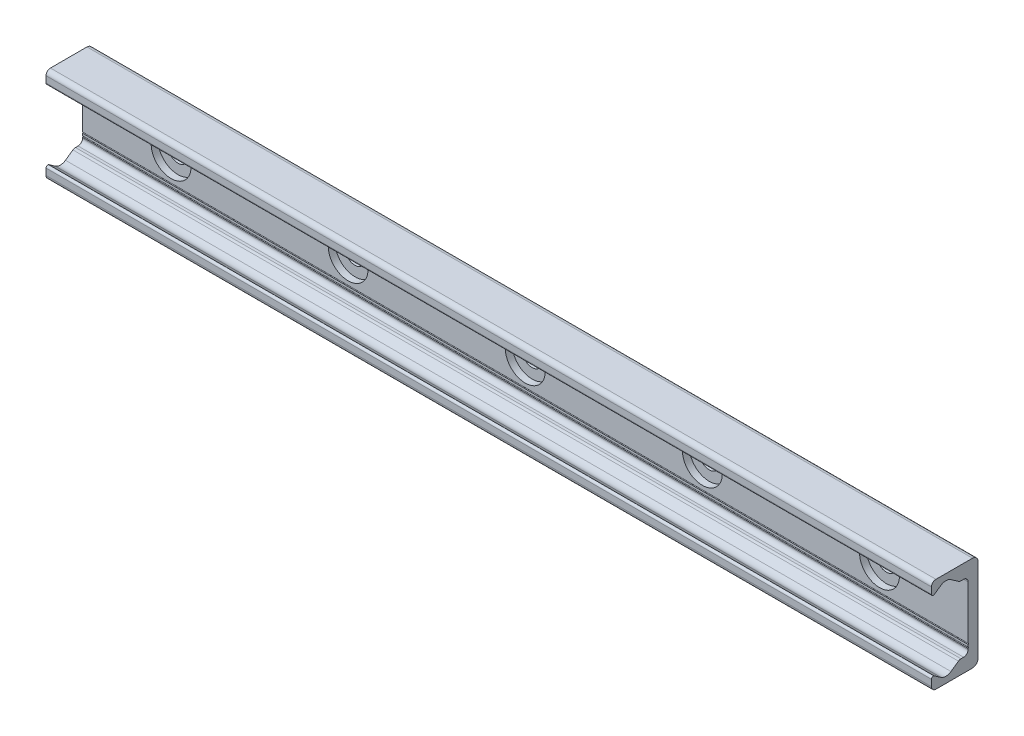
ISO-10303-21;
HEADER;
FILE_DESCRIPTION(('STEP AP214'),'2;1');
FILE_NAME('part.step','',(''),(''),'','','');
FILE_SCHEMA(('AUTOMOTIVE_DESIGN { 1 0 10303 214 1 1 1 1 }'));
ENDSEC;
DATA;
#1=APPLICATION_CONTEXT('core data for automotive mechanical design processes');
#2=APPLICATION_PROTOCOL_DEFINITION('international standard','automotive_design',2000,#1);
#3=PRODUCT_CONTEXT('',#1,'mechanical');
#4=PRODUCT('Part','Part','',(#3));
#5=PRODUCT_RELATED_PRODUCT_CATEGORY('part','',(#4));
#6=PRODUCT_DEFINITION_FORMATION('','',#4);
#7=PRODUCT_DEFINITION_CONTEXT('part definition',#1,'design');
#8=PRODUCT_DEFINITION('design','',#6,#7);
#9=PRODUCT_DEFINITION_SHAPE('','',#8);
#10=(LENGTH_UNIT() NAMED_UNIT(*) SI_UNIT(.MILLI.,.METRE.));
#11=(NAMED_UNIT(*) PLANE_ANGLE_UNIT() SI_UNIT($,.RADIAN.));
#12=(NAMED_UNIT(*) SI_UNIT($,.STERADIAN.) SOLID_ANGLE_UNIT());
#13=UNCERTAINTY_MEASURE_WITH_UNIT(LENGTH_MEASURE(1.E-05),#10,'distance_accuracy_value','');
#14=(GEOMETRIC_REPRESENTATION_CONTEXT(3) GLOBAL_UNCERTAINTY_ASSIGNED_CONTEXT((#13)) GLOBAL_UNIT_ASSIGNED_CONTEXT((#10,
#11,#12)) REPRESENTATION_CONTEXT('',''));
#15=CARTESIAN_POINT('',(0.,0.,0.));
#16=DIRECTION('',(0.,0.,1.));
#17=DIRECTION('',(1.,0.,0.));
#18=AXIS2_PLACEMENT_3D('',#15,#16,#17);
#19=CARTESIAN_POINT('',(-160.,0.,1.39999999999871));
#20=DIRECTION('',(0.,0.,1.));
#21=DIRECTION('',(1.,0.,0.));
#22=AXIS2_PLACEMENT_3D('',#19,#20,#21);
#23=PLANE('',#22);
#24=CARTESIAN_POINT('',(-160.,0.,1.39999999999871));
#25=DIRECTION('',(0.,0.,1.));
#26=DIRECTION('',(1.,0.,0.));
#27=AXIS2_PLACEMENT_3D('',#24,#25,#26);
#28=CIRCLE('',#27,4.49999999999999);
#29=CARTESIAN_POINT('',(-155.5,0.,1.39999999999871));
#30=VERTEX_POINT('',#29);
#31=EDGE_CURVE('E496',#30,#30,#28,.T.);
#32=ORIENTED_EDGE('',*,*,#31,.F.);
#33=EDGE_LOOP('',(#32));
#34=FACE_BOUND('',#33,.T.);
#35=CARTESIAN_POINT('',(-160.,0.,1.39999999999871));
#36=DIRECTION('',(0.,0.,1.));
#37=DIRECTION('',(1.,0.,0.));
#38=AXIS2_PLACEMENT_3D('',#35,#36,#37);
#39=CIRCLE('',#38,9.00000000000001);
#40=CARTESIAN_POINT('',(-151.,0.,1.39999999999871));
#41=VERTEX_POINT('',#40);
#42=EDGE_CURVE('E11',#41,#41,#39,.T.);
#43=ORIENTED_EDGE('',*,*,#42,.T.);
#44=EDGE_LOOP('',(#43));
#45=FACE_BOUND('',#44,.T.);
#46=ADVANCED_FACE('F39',(#34,#45),#23,.T.);
#47=CARTESIAN_POINT('',(-160.,0.,1.39999999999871));
#48=DIRECTION('',(0.,0.,1.));
#49=DIRECTION('',(1.,0.,0.));
#50=AXIS2_PLACEMENT_3D('',#47,#48,#49);
#51=CYLINDRICAL_SURFACE('',#50,9.00000000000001);
#52=CARTESIAN_POINT('',(-160.,0.,4.49999999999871));
#53=DIRECTION('',(0.,0.,1.));
#54=DIRECTION('',(1.,0.,0.));
#55=AXIS2_PLACEMENT_3D('',#52,#53,#54);
#56=CIRCLE('',#55,9.00000000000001);
#57=CARTESIAN_POINT('',(-151.,0.,4.49999999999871));
#58=VERTEX_POINT('',#57);
#59=EDGE_CURVE('E49',#58,#58,#56,.T.);
#60=CARTESIAN_POINT('',(-151.,0.,1.39999999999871));
#61=CARTESIAN_POINT('',(-151.,0.,1.43229166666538));
#62=CARTESIAN_POINT('',(-151.,0.,1.46458333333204));
#63=CARTESIAN_POINT('',(-151.,0.,1.52916666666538));
#64=CARTESIAN_POINT('',(-151.,0.,1.56145833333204));
#65=CARTESIAN_POINT('',(-151.,0.,1.62604166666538));
#66=CARTESIAN_POINT('',(-151.,0.,1.65833333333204));
#67=CARTESIAN_POINT('',(-151.,0.,1.72291666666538));
#68=CARTESIAN_POINT('',(-151.,0.,1.75520833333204));
#69=CARTESIAN_POINT('',(-151.,0.,1.81979166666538));
#70=CARTESIAN_POINT('',(-151.,0.,1.85208333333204));
#71=CARTESIAN_POINT('',(-151.,0.,1.91666666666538));
#72=CARTESIAN_POINT('',(-151.,0.,1.94895833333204));
#73=CARTESIAN_POINT('',(-151.,0.,2.01354166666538));
#74=CARTESIAN_POINT('',(-151.,0.,2.04583333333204));
#75=CARTESIAN_POINT('',(-151.,0.,2.11041666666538));
#76=CARTESIAN_POINT('',(-151.,0.,2.14270833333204));
#77=CARTESIAN_POINT('',(-151.,0.,2.20729166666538));
#78=CARTESIAN_POINT('',(-151.,0.,2.23958333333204));
#79=CARTESIAN_POINT('',(-151.,0.,2.30416666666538));
#80=CARTESIAN_POINT('',(-151.,0.,2.33645833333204));
#81=CARTESIAN_POINT('',(-151.,0.,2.40104166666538));
#82=CARTESIAN_POINT('',(-151.,0.,2.43333333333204));
#83=CARTESIAN_POINT('',(-151.,0.,2.49791666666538));
#84=CARTESIAN_POINT('',(-151.,0.,2.53020833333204));
#85=CARTESIAN_POINT('',(-151.,0.,2.59479166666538));
#86=CARTESIAN_POINT('',(-151.,0.,2.62708333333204));
#87=CARTESIAN_POINT('',(-151.,0.,2.69166666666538));
#88=CARTESIAN_POINT('',(-151.,0.,2.72395833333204));
#89=CARTESIAN_POINT('',(-151.,0.,2.78854166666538));
#90=CARTESIAN_POINT('',(-151.,0.,2.82083333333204));
#91=CARTESIAN_POINT('',(-151.,0.,2.88541666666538));
#92=CARTESIAN_POINT('',(-151.,0.,2.91770833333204));
#93=CARTESIAN_POINT('',(-151.,0.,2.98229166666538));
#94=CARTESIAN_POINT('',(-151.,0.,3.01458333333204));
#95=CARTESIAN_POINT('',(-151.,0.,3.07916666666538));
#96=CARTESIAN_POINT('',(-151.,0.,3.11145833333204));
#97=CARTESIAN_POINT('',(-151.,0.,3.17604166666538));
#98=CARTESIAN_POINT('',(-151.,0.,3.20833333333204));
#99=CARTESIAN_POINT('',(-151.,0.,3.27291666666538));
#100=CARTESIAN_POINT('',(-151.,0.,3.30520833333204));
#101=CARTESIAN_POINT('',(-151.,0.,3.36979166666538));
#102=CARTESIAN_POINT('',(-151.,0.,3.40208333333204));
#103=CARTESIAN_POINT('',(-151.,0.,3.46666666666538));
#104=CARTESIAN_POINT('',(-151.,0.,3.49895833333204));
#105=CARTESIAN_POINT('',(-151.,0.,3.56354166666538));
#106=CARTESIAN_POINT('',(-151.,0.,3.59583333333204));
#107=CARTESIAN_POINT('',(-151.,0.,3.66041666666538));
#108=CARTESIAN_POINT('',(-151.,0.,3.69270833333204));
#109=CARTESIAN_POINT('',(-151.,0.,3.75729166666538));
#110=CARTESIAN_POINT('',(-151.,0.,3.78958333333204));
#111=CARTESIAN_POINT('',(-151.,0.,3.85416666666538));
#112=CARTESIAN_POINT('',(-151.,0.,3.88645833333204));
#113=CARTESIAN_POINT('',(-151.,0.,3.95104166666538));
#114=CARTESIAN_POINT('',(-151.,0.,3.98333333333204));
#115=CARTESIAN_POINT('',(-151.,0.,4.04791666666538));
#116=CARTESIAN_POINT('',(-151.,0.,4.08020833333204));
#117=CARTESIAN_POINT('',(-151.,0.,4.14479166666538));
#118=CARTESIAN_POINT('',(-151.,0.,4.17708333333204));
#119=CARTESIAN_POINT('',(-151.,0.,4.24166666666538));
#120=CARTESIAN_POINT('',(-151.,0.,4.27395833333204));
#121=CARTESIAN_POINT('',(-151.,0.,4.33854166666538));
#122=CARTESIAN_POINT('',(-151.,0.,4.37083333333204));
#123=CARTESIAN_POINT('',(-151.,0.,4.43541666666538));
#124=CARTESIAN_POINT('',(-151.,0.,4.46770833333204));
#125=CARTESIAN_POINT('',(-151.,0.,4.49999999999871));
#126=B_SPLINE_CURVE_WITH_KNOTS('',3,(#60,#61,#62,#63,#64,#65,#66,#67,#68,#69,#70,#71,#72,#73,
#74,#75,#76,#77,#78,#79,#80,#81,#82,#83,#84,#85,#86,#87,#88,#89,#90,#91,#92,#93,#94,#95,#96,#97,
#98,#99,#100,#101,#102,#103,#104,#105,#106,#107,#108,#109,#110,#111,#112,#113,#114,#115,#116,
#117,#118,#119,#120,#121,#122,#123,#124,#125),.UNSPECIFIED.,.F.,.F.,(4,2,2,2,2,2,2,2,2,2,2,2,2,
2,2,2,2,2,2,2,2,2,2,2,2,2,2,2,2,2,2,2,4),(0.,0.0968750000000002,0.19375,0.290625,0.3875,
0.484375,0.58125,0.678125,0.775,0.871875,0.96875,1.065625,1.1625,1.259375,1.35625,1.453125,1.55,
1.646875,1.74375,1.840625,1.9375,2.034375,2.13125,2.228125,2.325,2.421875,2.51875,2.615625,
2.7125,2.809375,2.90625,3.003125,3.1),.UNSPECIFIED.);
#127=EDGE_CURVE('BSEAM466',#41,#58,#126,.T.);
#128=ORIENTED_EDGE('',*,*,#42,.F.);
#129=ORIENTED_EDGE('',*,*,#59,.T.);
#130=ORIENTED_EDGE('',*,*,#127,.T.);
#131=ORIENTED_EDGE('',*,*,#127,.F.);
#132=EDGE_LOOP('',(#128,#130,#129,#131));
#133=FACE_BOUND('',#132,.T.);
#134=ADVANCED_FACE('F466',(#133),#51,.F.);
#135=CARTESIAN_POINT('',(-80.,0.,1.39999999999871));
#136=DIRECTION('',(0.,0.,1.));
#137=DIRECTION('',(1.,0.,0.));
#138=AXIS2_PLACEMENT_3D('',#135,#136,#137);
#139=PLANE('',#138);
#140=CARTESIAN_POINT('',(-80.,0.,1.39999999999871));
#141=DIRECTION('',(0.,0.,1.));
#142=DIRECTION('',(1.,0.,0.));
#143=AXIS2_PLACEMENT_3D('',#140,#141,#142);
#144=CIRCLE('',#143,4.49999999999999);
#145=CARTESIAN_POINT('',(-75.5,0.,1.39999999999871));
#146=VERTEX_POINT('',#145);
#147=EDGE_CURVE('E500',#146,#146,#144,.T.);
#148=ORIENTED_EDGE('',*,*,#147,.F.);
#149=EDGE_LOOP('',(#148));
#150=FACE_BOUND('',#149,.T.);
#151=CARTESIAN_POINT('',(-80.,0.,1.39999999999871));
#152=DIRECTION('',(0.,0.,1.));
#153=DIRECTION('',(1.,0.,0.));
#154=AXIS2_PLACEMENT_3D('',#151,#152,#153);
#155=CIRCLE('',#154,9.00000000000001);
#156=CARTESIAN_POINT('',(-71.,0.,1.39999999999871));
#157=VERTEX_POINT('',#156);
#158=EDGE_CURVE('E458',#157,#157,#155,.T.);
#159=ORIENTED_EDGE('',*,*,#158,.T.);
#160=EDGE_LOOP('',(#159));
#161=FACE_BOUND('',#160,.T.);
#162=ADVANCED_FACE('F491',(#150,#161),#139,.T.);
#163=CARTESIAN_POINT('',(-80.,0.,1.39999999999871));
#164=DIRECTION('',(0.,0.,1.));
#165=DIRECTION('',(1.,0.,0.));
#166=AXIS2_PLACEMENT_3D('',#163,#164,#165);
#167=CYLINDRICAL_SURFACE('',#166,9.00000000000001);
#168=CARTESIAN_POINT('',(-80.,0.,4.49999999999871));
#169=DIRECTION('',(0.,0.,1.));
#170=DIRECTION('',(1.,0.,0.));
#171=AXIS2_PLACEMENT_3D('',#168,#169,#170);
#172=CIRCLE('',#171,9.00000000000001);
#173=CARTESIAN_POINT('',(-71.,0.,4.49999999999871));
#174=VERTEX_POINT('',#173);
#175=EDGE_CURVE('E454',#174,#174,#172,.T.);
#176=CARTESIAN_POINT('',(-71.,0.,1.39999999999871));
#177=CARTESIAN_POINT('',(-71.,0.,1.43229166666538));
#178=CARTESIAN_POINT('',(-71.,0.,1.46458333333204));
#179=CARTESIAN_POINT('',(-71.,0.,1.52916666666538));
#180=CARTESIAN_POINT('',(-71.,0.,1.56145833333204));
#181=CARTESIAN_POINT('',(-71.,0.,1.62604166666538));
#182=CARTESIAN_POINT('',(-71.,0.,1.65833333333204));
#183=CARTESIAN_POINT('',(-71.,0.,1.72291666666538));
#184=CARTESIAN_POINT('',(-71.,0.,1.75520833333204));
#185=CARTESIAN_POINT('',(-71.,0.,1.81979166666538));
#186=CARTESIAN_POINT('',(-71.,0.,1.85208333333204));
#187=CARTESIAN_POINT('',(-71.,0.,1.91666666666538));
#188=CARTESIAN_POINT('',(-71.,0.,1.94895833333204));
#189=CARTESIAN_POINT('',(-71.,0.,2.01354166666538));
#190=CARTESIAN_POINT('',(-71.,0.,2.04583333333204));
#191=CARTESIAN_POINT('',(-71.,0.,2.11041666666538));
#192=CARTESIAN_POINT('',(-71.,0.,2.14270833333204));
#193=CARTESIAN_POINT('',(-71.,0.,2.20729166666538));
#194=CARTESIAN_POINT('',(-71.,0.,2.23958333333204));
#195=CARTESIAN_POINT('',(-71.,0.,2.30416666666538));
#196=CARTESIAN_POINT('',(-71.,0.,2.33645833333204));
#197=CARTESIAN_POINT('',(-71.,0.,2.40104166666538));
#198=CARTESIAN_POINT('',(-71.,0.,2.43333333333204));
#199=CARTESIAN_POINT('',(-71.,0.,2.49791666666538));
#200=CARTESIAN_POINT('',(-71.,0.,2.53020833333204));
#201=CARTESIAN_POINT('',(-71.,0.,2.59479166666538));
#202=CARTESIAN_POINT('',(-71.,0.,2.62708333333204));
#203=CARTESIAN_POINT('',(-71.,0.,2.69166666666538));
#204=CARTESIAN_POINT('',(-71.,0.,2.72395833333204));
#205=CARTESIAN_POINT('',(-71.,0.,2.78854166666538));
#206=CARTESIAN_POINT('',(-71.,0.,2.82083333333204));
#207=CARTESIAN_POINT('',(-71.,0.,2.88541666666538));
#208=CARTESIAN_POINT('',(-71.,0.,2.91770833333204));
#209=CARTESIAN_POINT('',(-71.,0.,2.98229166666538));
#210=CARTESIAN_POINT('',(-71.,0.,3.01458333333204));
#211=CARTESIAN_POINT('',(-71.,0.,3.07916666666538));
#212=CARTESIAN_POINT('',(-71.,0.,3.11145833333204));
#213=CARTESIAN_POINT('',(-71.,0.,3.17604166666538));
#214=CARTESIAN_POINT('',(-71.,0.,3.20833333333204));
#215=CARTESIAN_POINT('',(-71.,0.,3.27291666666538));
#216=CARTESIAN_POINT('',(-71.,0.,3.30520833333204));
#217=CARTESIAN_POINT('',(-71.,0.,3.36979166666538));
#218=CARTESIAN_POINT('',(-71.,0.,3.40208333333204));
#219=CARTESIAN_POINT('',(-71.,0.,3.46666666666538));
#220=CARTESIAN_POINT('',(-71.,0.,3.49895833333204));
#221=CARTESIAN_POINT('',(-71.,0.,3.56354166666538));
#222=CARTESIAN_POINT('',(-71.,0.,3.59583333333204));
#223=CARTESIAN_POINT('',(-71.,0.,3.66041666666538));
#224=CARTESIAN_POINT('',(-71.,0.,3.69270833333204));
#225=CARTESIAN_POINT('',(-71.,0.,3.75729166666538));
#226=CARTESIAN_POINT('',(-71.,0.,3.78958333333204));
#227=CARTESIAN_POINT('',(-71.,0.,3.85416666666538));
#228=CARTESIAN_POINT('',(-71.,0.,3.88645833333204));
#229=CARTESIAN_POINT('',(-71.,0.,3.95104166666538));
#230=CARTESIAN_POINT('',(-71.,0.,3.98333333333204));
#231=CARTESIAN_POINT('',(-71.,0.,4.04791666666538));
#232=CARTESIAN_POINT('',(-71.,0.,4.08020833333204));
#233=CARTESIAN_POINT('',(-71.,0.,4.14479166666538));
#234=CARTESIAN_POINT('',(-71.,0.,4.17708333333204));
#235=CARTESIAN_POINT('',(-71.,0.,4.24166666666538));
#236=CARTESIAN_POINT('',(-71.,0.,4.27395833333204));
#237=CARTESIAN_POINT('',(-71.,0.,4.33854166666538));
#238=CARTESIAN_POINT('',(-71.,0.,4.37083333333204));
#239=CARTESIAN_POINT('',(-71.,0.,4.43541666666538));
#240=CARTESIAN_POINT('',(-71.,0.,4.46770833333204));
#241=CARTESIAN_POINT('',(-71.,0.,4.49999999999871));
#242=B_SPLINE_CURVE_WITH_KNOTS('',3,(#176,#177,#178,#179,#180,#181,#182,#183,#184,#185,#186,
#187,#188,#189,#190,#191,#192,#193,#194,#195,#196,#197,#198,#199,#200,#201,#202,#203,#204,#205,
#206,#207,#208,#209,#210,#211,#212,#213,#214,#215,#216,#217,#218,#219,#220,#221,#222,#223,#224,
#225,#226,#227,#228,#229,#230,#231,#232,#233,#234,#235,#236,#237,#238,#239,#240,#241),
.UNSPECIFIED.,.F.,.F.,(4,2,2,2,2,2,2,2,2,2,2,2,2,2,2,2,2,2,2,2,2,2,2,2,2,2,2,2,2,2,2,2,4),(0.,
0.0968750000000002,0.19375,0.290625,0.3875,0.484375,0.58125,0.678125,0.775,0.871875,0.96875,
1.065625,1.1625,1.259375,1.35625,1.453125,1.55,1.646875,1.74375,1.840625,1.9375,2.034375,
2.13125,2.228125,2.325,2.421875,2.51875,2.615625,2.7125,2.809375,2.90625,3.003125,3.1),.UNSPECIFIED.);
#243=EDGE_CURVE('BSEAM831',#157,#174,#242,.T.);
#244=ORIENTED_EDGE('',*,*,#158,.F.);
#245=ORIENTED_EDGE('',*,*,#175,.T.);
#246=ORIENTED_EDGE('',*,*,#243,.T.);
#247=ORIENTED_EDGE('',*,*,#243,.F.);
#248=EDGE_LOOP('',(#244,#246,#245,#247));
#249=FACE_BOUND('',#248,.T.);
#250=ADVANCED_FACE('F831',(#249),#167,.F.);
#251=CARTESIAN_POINT('',(0.,0.,1.39999999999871));
#252=DIRECTION('',(0.,0.,1.));
#253=DIRECTION('',(1.,0.,0.));
#254=AXIS2_PLACEMENT_3D('',#251,#252,#253);
#255=PLANE('',#254);
#256=CARTESIAN_POINT('',(0.,0.,1.39999999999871));
#257=DIRECTION('',(0.,0.,1.));
#258=DIRECTION('',(1.,0.,0.));
#259=AXIS2_PLACEMENT_3D('',#256,#257,#258);
#260=CIRCLE('',#259,4.49999999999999);
#261=CARTESIAN_POINT('',(4.49999999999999,0.,1.39999999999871));
#262=VERTEX_POINT('',#261);
#263=EDGE_CURVE('E504',#262,#262,#260,.T.);
#264=ORIENTED_EDGE('',*,*,#263,.F.);
#265=EDGE_LOOP('',(#264));
#266=FACE_BOUND('',#265,.T.);
#267=CARTESIAN_POINT('',(0.,0.,1.39999999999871));
#268=DIRECTION('',(0.,0.,1.));
#269=DIRECTION('',(1.,0.,0.));
#270=AXIS2_PLACEMENT_3D('',#267,#268,#269);
#271=CIRCLE('',#270,9.00000000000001);
#272=CARTESIAN_POINT('',(9.00000000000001,0.,1.39999999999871));
#273=VERTEX_POINT('',#272);
#274=EDGE_CURVE('E450',#273,#273,#271,.T.);
#275=ORIENTED_EDGE('',*,*,#274,.T.);
#276=EDGE_LOOP('',(#275));
#277=FACE_BOUND('',#276,.T.);
#278=ADVANCED_FACE('F823',(#266,#277),#255,.T.);
#279=CARTESIAN_POINT('',(0.,0.,1.39999999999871));
#280=DIRECTION('',(0.,0.,1.));
#281=DIRECTION('',(1.,0.,0.));
#282=AXIS2_PLACEMENT_3D('',#279,#280,#281);
#283=CYLINDRICAL_SURFACE('',#282,9.00000000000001);
#284=CARTESIAN_POINT('',(0.,0.,4.49999999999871));
#285=DIRECTION('',(0.,0.,1.));
#286=DIRECTION('',(1.,0.,0.));
#287=AXIS2_PLACEMENT_3D('',#284,#285,#286);
#288=CIRCLE('',#287,9.00000000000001);
#289=CARTESIAN_POINT('',(9.00000000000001,0.,4.49999999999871));
#290=VERTEX_POINT('',#289);
#291=EDGE_CURVE('E446',#290,#290,#288,.T.);
#292=CARTESIAN_POINT('',(9.00000000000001,0.,1.39999999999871));
#293=CARTESIAN_POINT('',(9.00000000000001,0.,1.43229166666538));
#294=CARTESIAN_POINT('',(9.00000000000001,0.,1.46458333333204));
#295=CARTESIAN_POINT('',(9.00000000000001,0.,1.52916666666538));
#296=CARTESIAN_POINT('',(9.00000000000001,0.,1.56145833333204));
#297=CARTESIAN_POINT('',(9.00000000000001,0.,1.62604166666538));
#298=CARTESIAN_POINT('',(9.00000000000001,0.,1.65833333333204));
#299=CARTESIAN_POINT('',(9.00000000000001,0.,1.72291666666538));
#300=CARTESIAN_POINT('',(9.00000000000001,0.,1.75520833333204));
#301=CARTESIAN_POINT('',(9.00000000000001,0.,1.81979166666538));
#302=CARTESIAN_POINT('',(9.00000000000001,0.,1.85208333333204));
#303=CARTESIAN_POINT('',(9.00000000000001,0.,1.91666666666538));
#304=CARTESIAN_POINT('',(9.00000000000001,0.,1.94895833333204));
#305=CARTESIAN_POINT('',(9.00000000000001,0.,2.01354166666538));
#306=CARTESIAN_POINT('',(9.00000000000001,0.,2.04583333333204));
#307=CARTESIAN_POINT('',(9.00000000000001,0.,2.11041666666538));
#308=CARTESIAN_POINT('',(9.00000000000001,0.,2.14270833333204));
#309=CARTESIAN_POINT('',(9.00000000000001,0.,2.20729166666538));
#310=CARTESIAN_POINT('',(9.00000000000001,0.,2.23958333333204));
#311=CARTESIAN_POINT('',(9.00000000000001,0.,2.30416666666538));
#312=CARTESIAN_POINT('',(9.00000000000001,0.,2.33645833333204));
#313=CARTESIAN_POINT('',(9.00000000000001,0.,2.40104166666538));
#314=CARTESIAN_POINT('',(9.00000000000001,0.,2.43333333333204));
#315=CARTESIAN_POINT('',(9.00000000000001,0.,2.49791666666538));
#316=CARTESIAN_POINT('',(9.00000000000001,0.,2.53020833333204));
#317=CARTESIAN_POINT('',(9.00000000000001,0.,2.59479166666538));
#318=CARTESIAN_POINT('',(9.00000000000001,0.,2.62708333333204));
#319=CARTESIAN_POINT('',(9.00000000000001,0.,2.69166666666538));
#320=CARTESIAN_POINT('',(9.00000000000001,0.,2.72395833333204));
#321=CARTESIAN_POINT('',(9.00000000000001,0.,2.78854166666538));
#322=CARTESIAN_POINT('',(9.00000000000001,0.,2.82083333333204));
#323=CARTESIAN_POINT('',(9.00000000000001,0.,2.88541666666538));
#324=CARTESIAN_POINT('',(9.00000000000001,0.,2.91770833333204));
#325=CARTESIAN_POINT('',(9.00000000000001,0.,2.98229166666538));
#326=CARTESIAN_POINT('',(9.00000000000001,0.,3.01458333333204));
#327=CARTESIAN_POINT('',(9.00000000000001,0.,3.07916666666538));
#328=CARTESIAN_POINT('',(9.00000000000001,0.,3.11145833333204));
#329=CARTESIAN_POINT('',(9.00000000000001,0.,3.17604166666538));
#330=CARTESIAN_POINT('',(9.00000000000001,0.,3.20833333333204));
#331=CARTESIAN_POINT('',(9.00000000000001,0.,3.27291666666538));
#332=CARTESIAN_POINT('',(9.00000000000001,0.,3.30520833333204));
#333=CARTESIAN_POINT('',(9.00000000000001,0.,3.36979166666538));
#334=CARTESIAN_POINT('',(9.00000000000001,0.,3.40208333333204));
#335=CARTESIAN_POINT('',(9.00000000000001,0.,3.46666666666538));
#336=CARTESIAN_POINT('',(9.00000000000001,0.,3.49895833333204));
#337=CARTESIAN_POINT('',(9.00000000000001,0.,3.56354166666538));
#338=CARTESIAN_POINT('',(9.00000000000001,0.,3.59583333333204));
#339=CARTESIAN_POINT('',(9.00000000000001,0.,3.66041666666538));
#340=CARTESIAN_POINT('',(9.00000000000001,0.,3.69270833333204));
#341=CARTESIAN_POINT('',(9.00000000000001,0.,3.75729166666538));
#342=CARTESIAN_POINT('',(9.00000000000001,0.,3.78958333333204));
#343=CARTESIAN_POINT('',(9.00000000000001,0.,3.85416666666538));
#344=CARTESIAN_POINT('',(9.00000000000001,0.,3.88645833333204));
#345=CARTESIAN_POINT('',(9.00000000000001,0.,3.95104166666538));
#346=CARTESIAN_POINT('',(9.00000000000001,0.,3.98333333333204));
#347=CARTESIAN_POINT('',(9.00000000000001,0.,4.04791666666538));
#348=CARTESIAN_POINT('',(9.00000000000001,0.,4.08020833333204));
#349=CARTESIAN_POINT('',(9.00000000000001,0.,4.14479166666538));
#350=CARTESIAN_POINT('',(9.00000000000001,0.,4.17708333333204));
#351=CARTESIAN_POINT('',(9.00000000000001,0.,4.24166666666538));
#352=CARTESIAN_POINT('',(9.00000000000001,0.,4.27395833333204));
#353=CARTESIAN_POINT('',(9.00000000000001,0.,4.33854166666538));
#354=CARTESIAN_POINT('',(9.00000000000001,0.,4.37083333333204));
#355=CARTESIAN_POINT('',(9.00000000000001,0.,4.43541666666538));
#356=CARTESIAN_POINT('',(9.00000000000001,0.,4.46770833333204));
#357=CARTESIAN_POINT('',(9.00000000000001,0.,4.49999999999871));
#358=B_SPLINE_CURVE_WITH_KNOTS('',3,(#292,#293,#294,#295,#296,#297,#298,#299,#300,#301,#302,
#303,#304,#305,#306,#307,#308,#309,#310,#311,#312,#313,#314,#315,#316,#317,#318,#319,#320,#321,
#322,#323,#324,#325,#326,#327,#328,#329,#330,#331,#332,#333,#334,#335,#336,#337,#338,#339,#340,
#341,#342,#343,#344,#345,#346,#347,#348,#349,#350,#351,#352,#353,#354,#355,#356,#357),
.UNSPECIFIED.,.F.,.F.,(4,2,2,2,2,2,2,2,2,2,2,2,2,2,2,2,2,2,2,2,2,2,2,2,2,2,2,2,2,2,2,2,4),(0.,
0.0968750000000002,0.19375,0.290625,0.3875,0.484375,0.58125,0.678125,0.775,0.871875,0.96875,
1.065625,1.1625,1.259375,1.35625,1.453125,1.55,1.646875,1.74375,1.840625,1.9375,2.034375,
2.13125,2.228125,2.325,2.421875,2.51875,2.615625,2.7125,2.809375,2.90625,3.003125,3.1),.UNSPECIFIED.);
#359=EDGE_CURVE('BSEAM816',#273,#290,#358,.T.);
#360=ORIENTED_EDGE('',*,*,#274,.F.);
#361=ORIENTED_EDGE('',*,*,#291,.T.);
#362=ORIENTED_EDGE('',*,*,#359,.T.);
#363=ORIENTED_EDGE('',*,*,#359,.F.);
#364=EDGE_LOOP('',(#360,#362,#361,#363));
#365=FACE_BOUND('',#364,.T.);
#366=ADVANCED_FACE('F816',(#365),#283,.F.);
#367=CARTESIAN_POINT('',(200.,0.,0.));
#368=DIRECTION('',(0.,0.,1.));
#369=DIRECTION('',(1.,0.,0.));
#370=AXIS2_PLACEMENT_3D('',#367,#368,#369);
#371=PLANE('',#370);
#372=CARTESIAN_POINT('',(80.,0.,0.));
#373=DIRECTION('',(0.,0.,1.));
#374=DIRECTION('',(1.,0.,0.));
#375=AXIS2_PLACEMENT_3D('',#372,#373,#374);
#376=CIRCLE('',#375,4.49999999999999);
#377=CARTESIAN_POINT('',(84.5,0.,0.));
#378=VERTEX_POINT('',#377);
#379=EDGE_CURVE('E508',#378,#378,#376,.T.);
#380=ORIENTED_EDGE('',*,*,#379,.T.);
#381=EDGE_LOOP('',(#380));
#382=FACE_BOUND('',#381,.T.);
#383=CARTESIAN_POINT('',(0.,0.,0.));
#384=DIRECTION('',(0.,0.,1.));
#385=DIRECTION('',(1.,0.,0.));
#386=AXIS2_PLACEMENT_3D('',#383,#384,#385);
#387=CIRCLE('',#386,4.49999999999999);
#388=CARTESIAN_POINT('',(4.49999999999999,0.,0.));
#389=VERTEX_POINT('',#388);
#390=EDGE_CURVE('E611',#389,#389,#387,.T.);
#391=ORIENTED_EDGE('',*,*,#390,.T.);
#392=EDGE_LOOP('',(#391));
#393=FACE_BOUND('',#392,.T.);
#394=CARTESIAN_POINT('',(-80.,0.,0.));
#395=DIRECTION('',(0.,0.,1.));
#396=DIRECTION('',(1.,0.,0.));
#397=AXIS2_PLACEMENT_3D('',#394,#395,#396);
#398=CIRCLE('',#397,4.49999999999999);
#399=CARTESIAN_POINT('',(-75.5,0.,0.));
#400=VERTEX_POINT('',#399);
#401=EDGE_CURVE('E613',#400,#400,#398,.T.);
#402=ORIENTED_EDGE('',*,*,#401,.T.);
#403=EDGE_LOOP('',(#402));
#404=FACE_BOUND('',#403,.T.);
#405=CARTESIAN_POINT('',(-160.,0.,0.));
#406=DIRECTION('',(0.,0.,1.));
#407=DIRECTION('',(1.,0.,0.));
#408=AXIS2_PLACEMENT_3D('',#405,#406,#407);
#409=CIRCLE('',#408,4.49999999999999);
#410=CARTESIAN_POINT('',(-155.5,0.,0.));
#411=VERTEX_POINT('',#410);
#412=EDGE_CURVE('E510',#411,#411,#409,.T.);
#413=ORIENTED_EDGE('',*,*,#412,.T.);
#414=EDGE_LOOP('',(#413));
#415=FACE_BOUND('',#414,.T.);
#416=CARTESIAN_POINT('',(160.,0.,0.));
#417=DIRECTION('',(0.,0.,1.));
#418=DIRECTION('',(1.,0.,0.));
#419=AXIS2_PLACEMENT_3D('',#416,#417,#418);
#420=CIRCLE('',#419,4.49999999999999);
#421=CARTESIAN_POINT('',(164.5,0.,0.));
#422=VERTEX_POINT('',#421);
#423=EDGE_CURVE('E524',#422,#422,#420,.T.);
#424=ORIENTED_EDGE('',*,*,#423,.T.);
#425=EDGE_LOOP('',(#424));
#426=FACE_BOUND('',#425,.T.);
#427=DIRECTION('',(0.,1.,0.));
#428=VECTOR('',#427,1.);
#429=CARTESIAN_POINT('',(-200.,0.,0.));
#430=LINE('',#429,#428);
#431=CARTESIAN_POINT('',(-200.,-19.,0.));
#432=VERTEX_POINT('',#431);
#433=CARTESIAN_POINT('',(-200.,19.,0.));
#434=VERTEX_POINT('',#433);
#435=EDGE_CURVE('E153',#432,#434,#430,.T.);
#436=ORIENTED_EDGE('',*,*,#435,.T.);
#437=DIRECTION('',(-1.,0.,0.));
#438=VECTOR('',#437,1.);
#439=CARTESIAN_POINT('',(200.,19.,0.));
#440=LINE('',#439,#438);
#441=CARTESIAN_POINT('',(200.,19.,0.));
#442=VERTEX_POINT('',#441);
#443=EDGE_CURVE('E442',#442,#434,#440,.T.);
#444=ORIENTED_EDGE('',*,*,#443,.F.);
#445=DIRECTION('',(0.,1.,0.));
#446=VECTOR('',#445,1.);
#447=CARTESIAN_POINT('',(200.,0.,0.));
#448=LINE('',#447,#446);
#449=CARTESIAN_POINT('',(200.,-19.,0.));
#450=VERTEX_POINT('',#449);
#451=EDGE_CURVE('E159',#450,#442,#448,.T.);
#452=ORIENTED_EDGE('',*,*,#451,.F.);
#453=DIRECTION('',(-1.,0.,0.));
#454=VECTOR('',#453,1.);
#455=CARTESIAN_POINT('',(200.,-19.,0.));
#456=LINE('',#455,#454);
#457=EDGE_CURVE('E258',#450,#432,#456,.T.);
#458=ORIENTED_EDGE('',*,*,#457,.T.);
#459=EDGE_LOOP('',(#436,#444,#452,#458));
#460=FACE_BOUND('',#459,.T.);
#461=ADVANCED_FACE('F628',(#382,#393,#404,#415,#426,#460),#371,.F.);
#462=CARTESIAN_POINT('',(200.,19.,2.5));
#463=DIRECTION('',(-1.,0.,0.));
#464=DIRECTION('',(0.,0.,1.));
#465=AXIS2_PLACEMENT_3D('',#462,#463,#464);
#466=CYLINDRICAL_SURFACE('',#465,2.5);
#467=CARTESIAN_POINT('',(-200.,19.,2.5));
#468=DIRECTION('',(1.,0.,0.));
#469=DIRECTION('',(0.,0.,-1.));
#470=AXIS2_PLACEMENT_3D('',#467,#468,#469);
#471=CIRCLE('',#470,2.5);
#472=CARTESIAN_POINT('',(-200.,21.5,2.5));
#473=VERTEX_POINT('',#472);
#474=EDGE_CURVE('E264',#434,#473,#471,.T.);
#475=ORIENTED_EDGE('',*,*,#474,.T.);
#476=DIRECTION('',(-1.,0.,0.));
#477=VECTOR('',#476,1.);
#478=CARTESIAN_POINT('',(200.,21.5,2.5));
#479=LINE('',#478,#477);
#480=CARTESIAN_POINT('',(200.,21.5,2.5));
#481=VERTEX_POINT('',#480);
#482=EDGE_CURVE('E438',#481,#473,#479,.T.);
#483=ORIENTED_EDGE('',*,*,#482,.F.);
#484=CARTESIAN_POINT('',(200.,19.,2.5));
#485=DIRECTION('',(1.,0.,0.));
#486=DIRECTION('',(0.,0.,-1.));
#487=AXIS2_PLACEMENT_3D('',#484,#485,#486);
#488=CIRCLE('',#487,2.5);
#489=EDGE_CURVE('E541',#442,#481,#488,.T.);
#490=ORIENTED_EDGE('',*,*,#489,.F.);
#491=ORIENTED_EDGE('',*,*,#443,.T.);
#492=EDGE_LOOP('',(#475,#483,#490,#491));
#493=FACE_BOUND('',#492,.T.);
#494=ADVANCED_FACE('F797',(#493),#466,.T.);
#495=CARTESIAN_POINT('',(200.,21.5,2.5));
#496=DIRECTION('',(0.,-1.,0.));
#497=DIRECTION('',(0.,0.,-1.));
#498=AXIS2_PLACEMENT_3D('',#495,#496,#497);
#499=PLANE('',#498);
#500=DIRECTION('',(0.,0.,1.));
#501=VECTOR('',#500,1.);
#502=CARTESIAN_POINT('',(-200.,21.5,2.5));
#503=LINE('',#502,#501);
#504=CARTESIAN_POINT('',(-200.,21.5,19.000000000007));
#505=VERTEX_POINT('',#504);
#506=EDGE_CURVE('E268',#473,#505,#503,.T.);
#507=ORIENTED_EDGE('',*,*,#506,.T.);
#508=DIRECTION('',(-1.,0.,0.));
#509=VECTOR('',#508,1.);
#510=CARTESIAN_POINT('',(200.,21.5,19.000000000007));
#511=LINE('',#510,#509);
#512=CARTESIAN_POINT('',(200.,21.5,19.000000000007));
#513=VERTEX_POINT('',#512);
#514=EDGE_CURVE('E434',#513,#505,#511,.T.);
#515=ORIENTED_EDGE('',*,*,#514,.F.);
#516=DIRECTION('',(0.,0.,1.));
#517=VECTOR('',#516,1.);
#518=CARTESIAN_POINT('',(200.,21.5,2.5));
#519=LINE('',#518,#517);
#520=EDGE_CURVE('E544',#481,#513,#519,.T.);
#521=ORIENTED_EDGE('',*,*,#520,.F.);
#522=ORIENTED_EDGE('',*,*,#482,.T.);
#523=EDGE_LOOP('',(#507,#515,#521,#522));
#524=FACE_BOUND('',#523,.T.);
#525=ADVANCED_FACE('F793',(#524),#499,.F.);
#526=CARTESIAN_POINT('',(200.,19.4999999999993,19.000000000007));
#527=DIRECTION('',(-1.,0.,0.));
#528=DIRECTION('',(0.,0.,1.));
#529=AXIS2_PLACEMENT_3D('',#526,#527,#528);
#530=CYLINDRICAL_SURFACE('',#529,2.00000000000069);
#531=CARTESIAN_POINT('',(-200.,19.4999999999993,19.000000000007));
#532=DIRECTION('',(1.,0.,0.));
#533=DIRECTION('',(0.,0.,-1.));
#534=AXIS2_PLACEMENT_3D('',#531,#532,#533);
#535=CIRCLE('',#534,2.00000000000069);
#536=CARTESIAN_POINT('',(-200.,19.4999999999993,21.0000000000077));
#537=VERTEX_POINT('',#536);
#538=EDGE_CURVE('E271',#505,#537,#535,.T.);
#539=ORIENTED_EDGE('',*,*,#538,.T.);
#540=DIRECTION('',(-1.,0.,0.));
#541=VECTOR('',#540,1.);
#542=CARTESIAN_POINT('',(200.,19.4999999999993,21.0000000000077));
#543=LINE('',#542,#541);
#544=CARTESIAN_POINT('',(200.,19.4999999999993,21.0000000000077));
#545=VERTEX_POINT('',#544);
#546=EDGE_CURVE('E431',#545,#537,#543,.T.);
#547=ORIENTED_EDGE('',*,*,#546,.F.);
#548=CARTESIAN_POINT('',(200.,19.4999999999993,19.000000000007));
#549=DIRECTION('',(1.,0.,0.));
#550=DIRECTION('',(0.,0.,-1.));
#551=AXIS2_PLACEMENT_3D('',#548,#549,#550);
#552=CIRCLE('',#551,2.00000000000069);
#553=EDGE_CURVE('E547',#513,#545,#552,.T.);
#554=ORIENTED_EDGE('',*,*,#553,.F.);
#555=ORIENTED_EDGE('',*,*,#514,.T.);
#556=EDGE_LOOP('',(#539,#547,#554,#555));
#557=FACE_BOUND('',#556,.T.);
#558=ADVANCED_FACE('F788',(#557),#530,.T.);
#559=CARTESIAN_POINT('',(200.,19.4999999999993,21.0000000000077));
#560=DIRECTION('',(0.,0.,-1.));
#561=DIRECTION('',(-1.,0.,0.));
#562=AXIS2_PLACEMENT_3D('',#559,#560,#561);
#563=PLANE('',#562);
#564=DIRECTION('',(0.,-1.,0.));
#565=VECTOR('',#564,1.);
#566=CARTESIAN_POINT('',(-200.,19.4999999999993,21.0000000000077));
#567=LINE('',#566,#565);
#568=CARTESIAN_POINT('',(-200.,16.6250570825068,21.0000000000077));
#569=VERTEX_POINT('',#568);
#570=EDGE_CURVE('E274',#537,#569,#567,.T.);
#571=ORIENTED_EDGE('',*,*,#570,.T.);
#572=DIRECTION('',(-1.,0.,0.));
#573=VECTOR('',#572,1.);
#574=CARTESIAN_POINT('',(200.,16.6250570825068,21.0000000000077));
#575=LINE('',#574,#573);
#576=CARTESIAN_POINT('',(200.,16.6250570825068,21.0000000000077));
#577=VERTEX_POINT('',#576);
#578=EDGE_CURVE('E427',#577,#569,#575,.T.);
#579=ORIENTED_EDGE('',*,*,#578,.F.);
#580=DIRECTION('',(0.,-1.,0.));
#581=VECTOR('',#580,1.);
#582=CARTESIAN_POINT('',(200.,19.4999999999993,21.0000000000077));
#583=LINE('',#582,#581);
#584=EDGE_CURVE('E550',#545,#577,#583,.T.);
#585=ORIENTED_EDGE('',*,*,#584,.F.);
#586=ORIENTED_EDGE('',*,*,#546,.T.);
#587=EDGE_LOOP('',(#571,#579,#585,#586));
#588=FACE_BOUND('',#587,.T.);
#589=ADVANCED_FACE('F783',(#588),#563,.F.);
#590=CARTESIAN_POINT('',(200.,16.6250570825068,20.1700000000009));
#591=DIRECTION('',(-1.,0.,0.));
#592=DIRECTION('',(0.,0.,1.));
#593=AXIS2_PLACEMENT_3D('',#590,#591,#592);
#594=CYLINDRICAL_SURFACE('',#593,0.83000000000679);
#595=CARTESIAN_POINT('',(-200.,16.6250570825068,20.1700000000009));
#596=DIRECTION('',(1.,0.,0.));
#597=DIRECTION('',(0.,0.,-1.));
#598=AXIS2_PLACEMENT_3D('',#595,#596,#597);
#599=CIRCLE('',#598,0.83000000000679);
#600=CARTESIAN_POINT('',(-200.,15.9451608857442,19.6939315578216));
#601=VERTEX_POINT('',#600);
#602=EDGE_CURVE('E277',#569,#601,#599,.T.);
#603=ORIENTED_EDGE('',*,*,#602,.T.);
#604=DIRECTION('',(-1.,0.,0.));
#605=VECTOR('',#604,1.);
#606=CARTESIAN_POINT('',(200.,15.9451608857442,19.6939315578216));
#607=LINE('',#606,#605);
#608=CARTESIAN_POINT('',(200.,15.9451608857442,19.6939315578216));
#609=VERTEX_POINT('',#608);
#610=EDGE_CURVE('E423',#609,#601,#607,.T.);
#611=ORIENTED_EDGE('',*,*,#610,.F.);
#612=CARTESIAN_POINT('',(200.,16.6250570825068,20.1700000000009));
#613=DIRECTION('',(1.,0.,0.));
#614=DIRECTION('',(0.,0.,-1.));
#615=AXIS2_PLACEMENT_3D('',#612,#613,#614);
#616=CIRCLE('',#615,0.83000000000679);
#617=EDGE_CURVE('E553',#577,#609,#616,.T.);
#618=ORIENTED_EDGE('',*,*,#617,.F.);
#619=ORIENTED_EDGE('',*,*,#578,.T.);
#620=EDGE_LOOP('',(#603,#611,#618,#619));
#621=FACE_BOUND('',#620,.T.);
#622=ADVANCED_FACE('F779',(#621),#594,.T.);
#623=CARTESIAN_POINT('',(200.,15.9451608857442,19.6939315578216));
#624=DIRECTION('',(0.,0.81915204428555,0.573576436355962));
#625=DIRECTION('',(0.,-0.573576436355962,0.81915204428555));
#626=AXIS2_PLACEMENT_3D('',#623,#624,#625);
#627=PLANE('',#626);
#628=DIRECTION('',(0.,0.573576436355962,-0.81915204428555));
#629=VECTOR('',#628,1.);
#630=CARTESIAN_POINT('',(-200.,15.9451608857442,19.6939315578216));
#631=LINE('',#630,#629);
#632=CARTESIAN_POINT('',(-200.,17.975500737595,16.7943057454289));
#633=VERTEX_POINT('',#632);
#634=EDGE_CURVE('E280',#601,#633,#631,.T.);
#635=ORIENTED_EDGE('',*,*,#634,.T.);
#636=DIRECTION('',(-1.,0.,0.));
#637=VECTOR('',#636,1.);
#638=CARTESIAN_POINT('',(200.,17.975500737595,16.7943057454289));
#639=LINE('',#638,#637);
#640=CARTESIAN_POINT('',(200.,17.975500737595,16.7943057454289));
#641=VERTEX_POINT('',#640);
#642=EDGE_CURVE('E419',#641,#633,#639,.T.);
#643=ORIENTED_EDGE('',*,*,#642,.F.);
#644=DIRECTION('',(0.,0.573576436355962,-0.81915204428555));
#645=VECTOR('',#644,1.);
#646=CARTESIAN_POINT('',(200.,15.9451608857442,19.6939315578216));
#647=LINE('',#646,#645);
#648=EDGE_CURVE('E556',#609,#641,#647,.T.);
#649=ORIENTED_EDGE('',*,*,#648,.F.);
#650=ORIENTED_EDGE('',*,*,#610,.T.);
#651=EDGE_LOOP('',(#635,#643,#649,#650));
#652=FACE_BOUND('',#651,.T.);
#653=ADVANCED_FACE('F774',(#652),#627,.F.);
#654=CARTESIAN_POINT('',(200.,14.6988925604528,14.5000000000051));
#655=DIRECTION('',(-1.,0.,0.));
#656=DIRECTION('',(0.,0.,1.));
#657=AXIS2_PLACEMENT_3D('',#654,#655,#656);
#658=CYLINDRICAL_SURFACE('',#657,3.99999999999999);
#659=CARTESIAN_POINT('',(-200.,14.6988925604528,14.5000000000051));
#660=DIRECTION('',(-1.,0.,0.));
#661=DIRECTION('',(0.,0.,1.));
#662=AXIS2_PLACEMENT_3D('',#659,#660,#661);
#663=CIRCLE('',#662,3.99999999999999);
#664=CARTESIAN_POINT('',(-200.,17.975500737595,12.2056942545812));
#665=VERTEX_POINT('',#664);
#666=EDGE_CURVE('E283',#633,#665,#663,.T.);
#667=ORIENTED_EDGE('',*,*,#666,.T.);
#668=DIRECTION('',(-1.,0.,0.));
#669=VECTOR('',#668,1.);
#670=CARTESIAN_POINT('',(200.,17.975500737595,12.2056942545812));
#671=LINE('',#670,#669);
#672=CARTESIAN_POINT('',(200.,17.975500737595,12.2056942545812));
#673=VERTEX_POINT('',#672);
#674=EDGE_CURVE('E415',#673,#665,#671,.T.);
#675=ORIENTED_EDGE('',*,*,#674,.F.);
#676=CARTESIAN_POINT('',(200.,14.6988925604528,14.5000000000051));
#677=DIRECTION('',(-1.,0.,0.));
#678=DIRECTION('',(0.,0.,1.));
#679=AXIS2_PLACEMENT_3D('',#676,#677,#678);
#680=CIRCLE('',#679,3.99999999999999);
#681=EDGE_CURVE('E559',#641,#673,#680,.T.);
#682=ORIENTED_EDGE('',*,*,#681,.F.);
#683=ORIENTED_EDGE('',*,*,#642,.T.);
#684=EDGE_LOOP('',(#667,#675,#682,#683));
#685=FACE_BOUND('',#684,.T.);
#686=ADVANCED_FACE('F768',(#685),#658,.F.);
#687=CARTESIAN_POINT('',(200.,17.975500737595,12.2056942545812));
#688=DIRECTION('',(0.,0.81915204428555,-0.573576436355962));
#689=DIRECTION('',(0.,0.573576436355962,0.81915204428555));
#690=AXIS2_PLACEMENT_3D('',#687,#688,#689);
#691=PLANE('',#690);
#692=DIRECTION('',(0.,-0.573576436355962,-0.81915204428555));
#693=VECTOR('',#692,1.);
#694=CARTESIAN_POINT('',(-200.,17.975500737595,12.2056942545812));
#695=LINE('',#694,#693);
#696=CARTESIAN_POINT('',(-200.,15.6116959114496,8.82983110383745));
#697=VERTEX_POINT('',#696);
#698=EDGE_CURVE('E286',#665,#697,#695,.T.);
#699=ORIENTED_EDGE('',*,*,#698,.T.);
#700=DIRECTION('',(-1.,0.,0.));
#701=VECTOR('',#700,1.);
#702=CARTESIAN_POINT('',(200.,15.6116959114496,8.82983110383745));
#703=LINE('',#702,#701);
#704=CARTESIAN_POINT('',(200.,15.6116959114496,8.82983110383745));
#705=VERTEX_POINT('',#704);
#706=EDGE_CURVE('E411',#705,#697,#703,.T.);
#707=ORIENTED_EDGE('',*,*,#706,.F.);
#708=DIRECTION('',(0.,-0.573576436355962,-0.81915204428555));
#709=VECTOR('',#708,1.);
#710=CARTESIAN_POINT('',(200.,17.975500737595,12.2056942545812));
#711=LINE('',#710,#709);
#712=EDGE_CURVE('E562',#673,#705,#711,.T.);
#713=ORIENTED_EDGE('',*,*,#712,.F.);
#714=ORIENTED_EDGE('',*,*,#674,.T.);
#715=EDGE_LOOP('',(#699,#707,#713,#714));
#716=FACE_BOUND('',#715,.T.);
#717=ADVANCED_FACE('F764',(#716),#691,.F.);
#718=CARTESIAN_POINT('',(200.,17.2500000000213,7.68267823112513));
#719=DIRECTION('',(-1.,0.,0.));
#720=DIRECTION('',(0.,0.,1.));
#721=AXIS2_PLACEMENT_3D('',#718,#719,#720);
#722=CYLINDRICAL_SURFACE('',#721,2.00000000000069);
#723=CARTESIAN_POINT('',(-200.,17.2500000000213,7.68267823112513));
#724=DIRECTION('',(1.,0.,0.));
#725=DIRECTION('',(0.,0.,-1.));
#726=AXIS2_PLACEMENT_3D('',#723,#724,#725);
#727=CIRCLE('',#726,2.00000000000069);
#728=CARTESIAN_POINT('',(-200.,15.2500000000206,7.68267823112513));
#729=VERTEX_POINT('',#728);
#730=EDGE_CURVE('E289',#697,#729,#727,.T.);
#731=ORIENTED_EDGE('',*,*,#730,.T.);
#732=DIRECTION('',(-1.,0.,0.));
#733=VECTOR('',#732,1.);
#734=CARTESIAN_POINT('',(200.,15.2500000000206,7.68267823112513));
#735=LINE('',#734,#733);
#736=CARTESIAN_POINT('',(200.,15.2500000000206,7.68267823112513));
#737=VERTEX_POINT('',#736);
#738=EDGE_CURVE('E407',#737,#729,#735,.T.);
#739=ORIENTED_EDGE('',*,*,#738,.F.);
#740=CARTESIAN_POINT('',(200.,17.2500000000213,7.68267823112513));
#741=DIRECTION('',(1.,0.,0.));
#742=DIRECTION('',(0.,0.,-1.));
#743=AXIS2_PLACEMENT_3D('',#740,#741,#742);
#744=CIRCLE('',#743,2.00000000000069);
#745=EDGE_CURVE('E565',#705,#737,#744,.T.);
#746=ORIENTED_EDGE('',*,*,#745,.F.);
#747=ORIENTED_EDGE('',*,*,#706,.T.);
#748=EDGE_LOOP('',(#731,#739,#746,#747));
#749=FACE_BOUND('',#748,.T.);
#750=ADVANCED_FACE('F759',(#749),#722,.T.);
#751=CARTESIAN_POINT('',(200.,15.2500000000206,7.68267823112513));
#752=DIRECTION('',(0.,1.,0.));
#753=DIRECTION('',(0.,0.,1.));
#754=AXIS2_PLACEMENT_3D('',#751,#752,#753);
#755=PLANE('',#754);
#756=DIRECTION('',(0.,0.,-1.));
#757=VECTOR('',#756,1.);
#758=CARTESIAN_POINT('',(-200.,15.2500000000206,7.68267823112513));
#759=LINE('',#758,#757);
#760=CARTESIAN_POINT('',(-200.,15.2500000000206,6.4999999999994));
#761=VERTEX_POINT('',#760);
#762=EDGE_CURVE('E292',#729,#761,#759,.T.);
#763=ORIENTED_EDGE('',*,*,#762,.T.);
#764=DIRECTION('',(-1.,0.,0.));
#765=VECTOR('',#764,1.);
#766=CARTESIAN_POINT('',(200.,15.2500000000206,6.4999999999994));
#767=LINE('',#766,#765);
#768=CARTESIAN_POINT('',(200.,15.2500000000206,6.4999999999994));
#769=VERTEX_POINT('',#768);
#770=EDGE_CURVE('E403',#769,#761,#767,.T.);
#771=ORIENTED_EDGE('',*,*,#770,.F.);
#772=DIRECTION('',(0.,0.,-1.));
#773=VECTOR('',#772,1.);
#774=CARTESIAN_POINT('',(200.,15.2500000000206,7.68267823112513));
#775=LINE('',#774,#773);
#776=EDGE_CURVE('E568',#737,#769,#775,.T.);
#777=ORIENTED_EDGE('',*,*,#776,.F.);
#778=ORIENTED_EDGE('',*,*,#738,.T.);
#779=EDGE_LOOP('',(#763,#771,#777,#778));
#780=FACE_BOUND('',#779,.T.);
#781=ADVANCED_FACE('F481',(#780),#755,.F.);
#782=CARTESIAN_POINT('',(200.,13.2500000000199,6.4999999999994));
#783=DIRECTION('',(-1.,0.,0.));
#784=DIRECTION('',(0.,0.,1.));
#785=AXIS2_PLACEMENT_3D('',#782,#783,#784);
#786=CYLINDRICAL_SURFACE('',#785,2.00000000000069);
#787=CARTESIAN_POINT('',(-200.,13.2500000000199,6.4999999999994));
#788=DIRECTION('',(-1.,0.,0.));
#789=DIRECTION('',(0.,0.,1.));
#790=AXIS2_PLACEMENT_3D('',#787,#788,#789);
#791=CIRCLE('',#790,2.00000000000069);
#792=CARTESIAN_POINT('',(-200.,13.2500000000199,4.49999999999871));
#793=VERTEX_POINT('',#792);
#794=EDGE_CURVE('E295',#761,#793,#791,.T.);
#795=ORIENTED_EDGE('',*,*,#794,.T.);
#796=DIRECTION('',(-1.,0.,0.));
#797=VECTOR('',#796,1.);
#798=CARTESIAN_POINT('',(200.,13.2500000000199,4.49999999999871));
#799=LINE('',#798,#797);
#800=CARTESIAN_POINT('',(200.,13.2500000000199,4.49999999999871));
#801=VERTEX_POINT('',#800);
#802=EDGE_CURVE('E399',#801,#793,#799,.T.);
#803=ORIENTED_EDGE('',*,*,#802,.F.);
#804=CARTESIAN_POINT('',(200.,13.2500000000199,6.4999999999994));
#805=DIRECTION('',(-1.,0.,0.));
#806=DIRECTION('',(0.,0.,1.));
#807=AXIS2_PLACEMENT_3D('',#804,#805,#806);
#808=CIRCLE('',#807,2.00000000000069);
#809=EDGE_CURVE('E571',#769,#801,#808,.T.);
#810=ORIENTED_EDGE('',*,*,#809,.F.);
#811=ORIENTED_EDGE('',*,*,#770,.T.);
#812=EDGE_LOOP('',(#795,#803,#810,#811));
#813=FACE_BOUND('',#812,.T.);
#814=ADVANCED_FACE('F471',(#813),#786,.F.);
#815=CARTESIAN_POINT('',(200.,13.2500000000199,4.49999999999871));
#816=DIRECTION('',(0.,0.,-1.));
#817=DIRECTION('',(0.,1.,0.));
#818=AXIS2_PLACEMENT_3D('',#815,#816,#817);
#819=PLANE('',#818);
#820=CARTESIAN_POINT('',(80.,0.,4.49999999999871));
#821=DIRECTION('',(0.,0.,1.));
#822=DIRECTION('',(1.,0.,0.));
#823=AXIS2_PLACEMENT_3D('',#820,#821,#822);
#824=CIRCLE('',#823,9.00000000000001);
#825=CARTESIAN_POINT('',(89.,0.,4.49999999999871));
#826=VERTEX_POINT('',#825);
#827=EDGE_CURVE('E516',#826,#826,#824,.T.);
#828=ORIENTED_EDGE('',*,*,#827,.F.);
#829=EDGE_LOOP('',(#828));
#830=FACE_BOUND('',#829,.T.);
#831=CARTESIAN_POINT('',(160.,0.,4.49999999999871));
#832=DIRECTION('',(0.,0.,1.));
#833=DIRECTION('',(1.,0.,0.));
#834=AXIS2_PLACEMENT_3D('',#831,#832,#833);
#835=CIRCLE('',#834,9.00000000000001);
#836=CARTESIAN_POINT('',(169.,0.,4.49999999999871));
#837=VERTEX_POINT('',#836);
#838=EDGE_CURVE('E532',#837,#837,#835,.T.);
#839=ORIENTED_EDGE('',*,*,#838,.F.);
#840=EDGE_LOOP('',(#839));
#841=FACE_BOUND('',#840,.T.);
#842=DIRECTION('',(0.,-1.,0.));
#843=VECTOR('',#842,1.);
#844=CARTESIAN_POINT('',(-200.,13.2500000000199,4.49999999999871));
#845=LINE('',#844,#843);
#846=CARTESIAN_POINT('',(-200.,-10.75,4.49999999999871));
#847=VERTEX_POINT('',#846);
#848=EDGE_CURVE('E298',#793,#847,#845,.T.);
#849=ORIENTED_EDGE('',*,*,#848,.T.);
#850=DIRECTION('',(-1.,0.,0.));
#851=VECTOR('',#850,1.);
#852=CARTESIAN_POINT('',(200.,-10.75,4.49999999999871));
#853=LINE('',#852,#851);
#854=CARTESIAN_POINT('',(200.,-10.75,4.49999999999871));
#855=VERTEX_POINT('',#854);
#856=EDGE_CURVE('E395',#855,#847,#853,.T.);
#857=ORIENTED_EDGE('',*,*,#856,.F.);
#858=DIRECTION('',(0.,-1.,0.));
#859=VECTOR('',#858,1.);
#860=CARTESIAN_POINT('',(200.,13.2500000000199,4.49999999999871));
#861=LINE('',#860,#859);
#862=EDGE_CURVE('E574',#801,#855,#861,.T.);
#863=ORIENTED_EDGE('',*,*,#862,.F.);
#864=ORIENTED_EDGE('',*,*,#802,.T.);
#865=EDGE_LOOP('',(#849,#857,#863,#864));
#866=FACE_BOUND('',#865,.T.);
#867=ORIENTED_EDGE('',*,*,#291,.F.);
#868=EDGE_LOOP('',(#867));
#869=FACE_BOUND('',#868,.T.);
#870=ORIENTED_EDGE('',*,*,#175,.F.);
#871=EDGE_LOOP('',(#870));
#872=FACE_BOUND('',#871,.T.);
#873=ORIENTED_EDGE('',*,*,#59,.F.);
#874=EDGE_LOOP('',(#873));
#875=FACE_BOUND('',#874,.T.);
#876=ADVANCED_FACE('F468',(#830,#841,#866,#869,#872,#875),#819,.F.);
#877=CARTESIAN_POINT('',(200.,-11.,4.49999999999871));
#878=DIRECTION('',(-1.,0.,0.));
#879=DIRECTION('',(0.,0.,1.));
#880=AXIS2_PLACEMENT_3D('',#877,#878,#879);
#881=CYLINDRICAL_SURFACE('',#880,0.25);
#882=CARTESIAN_POINT('',(-200.,-11.,4.49999999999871));
#883=DIRECTION('',(-1.,0.,0.));
#884=DIRECTION('',(0.,0.,-1.));
#885=AXIS2_PLACEMENT_3D('',#882,#883,#884);
#886=CIRCLE('',#885,0.25);
#887=CARTESIAN_POINT('',(-200.,-11.25,4.49999999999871));
#888=VERTEX_POINT('',#887);
#889=EDGE_CURVE('E301',#847,#888,#886,.T.);
#890=ORIENTED_EDGE('',*,*,#889,.T.);
#891=DIRECTION('',(-1.,0.,0.));
#892=VECTOR('',#891,1.);
#893=CARTESIAN_POINT('',(200.,-11.25,4.49999999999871));
#894=LINE('',#893,#892);
#895=CARTESIAN_POINT('',(200.,-11.25,4.49999999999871));
#896=VERTEX_POINT('',#895);
#897=EDGE_CURVE('E391',#896,#888,#894,.T.);
#898=ORIENTED_EDGE('',*,*,#897,.F.);
#899=CARTESIAN_POINT('',(200.,-11.,4.49999999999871));
#900=DIRECTION('',(-1.,0.,0.));
#901=DIRECTION('',(0.,0.,-1.));
#902=AXIS2_PLACEMENT_3D('',#899,#900,#901);
#903=CIRCLE('',#902,0.25);
#904=EDGE_CURVE('E577',#855,#896,#903,.T.);
#905=ORIENTED_EDGE('',*,*,#904,.F.);
#906=ORIENTED_EDGE('',*,*,#856,.T.);
#907=EDGE_LOOP('',(#890,#898,#905,#906));
#908=FACE_BOUND('',#907,.T.);
#909=ADVANCED_FACE('F470',(#908),#881,.F.);
#910=CARTESIAN_POINT('',(200.,-12.25,4.49999999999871));
#911=DIRECTION('',(0.,0.,-1.));
#912=DIRECTION('',(-1.,0.,0.));
#913=AXIS2_PLACEMENT_3D('',#910,#911,#912);
#914=PLANE('',#913);
#915=DIRECTION('',(0.,-1.,0.));
#916=VECTOR('',#915,1.);
#917=CARTESIAN_POINT('',(-200.,-12.25,4.49999999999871));
#918=LINE('',#917,#916);
#919=CARTESIAN_POINT('',(-200.,-12.25,4.49999999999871));
#920=VERTEX_POINT('',#919);
#921=EDGE_CURVE('E304',#888,#920,#918,.T.);
#922=ORIENTED_EDGE('',*,*,#921,.T.);
#923=DIRECTION('',(-1.,0.,0.));
#924=VECTOR('',#923,1.);
#925=CARTESIAN_POINT('',(200.,-12.25,4.49999999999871));
#926=LINE('',#925,#924);
#927=CARTESIAN_POINT('',(200.,-12.25,4.49999999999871));
#928=VERTEX_POINT('',#927);
#929=EDGE_CURVE('E387',#928,#920,#926,.T.);
#930=ORIENTED_EDGE('',*,*,#929,.F.);
#931=DIRECTION('',(0.,-1.,0.));
#932=VECTOR('',#931,1.);
#933=CARTESIAN_POINT('',(200.,-12.25,4.49999999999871));
#934=LINE('',#933,#932);
#935=EDGE_CURVE('E580',#896,#928,#934,.T.);
#936=ORIENTED_EDGE('',*,*,#935,.F.);
#937=ORIENTED_EDGE('',*,*,#897,.T.);
#938=EDGE_LOOP('',(#922,#930,#936,#937));
#939=FACE_BOUND('',#938,.T.);
#940=ADVANCED_FACE('F478',(#939),#914,.F.);
#941=CARTESIAN_POINT('',(200.,-12.5,4.49999999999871));
#942=DIRECTION('',(-1.,0.,0.));
#943=DIRECTION('',(0.,0.,1.));
#944=AXIS2_PLACEMENT_3D('',#941,#942,#943);
#945=CYLINDRICAL_SURFACE('',#944,0.25);
#946=CARTESIAN_POINT('',(-200.,-12.5,4.49999999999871));
#947=DIRECTION('',(-1.,0.,0.));
#948=DIRECTION('',(0.,0.,-1.));
#949=AXIS2_PLACEMENT_3D('',#946,#947,#948);
#950=CIRCLE('',#949,0.25);
#951=CARTESIAN_POINT('',(-200.,-12.75,4.49999999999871));
#952=VERTEX_POINT('',#951);
#953=EDGE_CURVE('E307',#920,#952,#950,.T.);
#954=ORIENTED_EDGE('',*,*,#953,.T.);
#955=DIRECTION('',(-1.,0.,0.));
#956=VECTOR('',#955,1.);
#957=CARTESIAN_POINT('',(200.,-12.75,4.49999999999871));
#958=LINE('',#957,#956);
#959=CARTESIAN_POINT('',(200.,-12.75,4.49999999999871));
#960=VERTEX_POINT('',#959);
#961=EDGE_CURVE('E383',#960,#952,#958,.T.);
#962=ORIENTED_EDGE('',*,*,#961,.F.);
#963=CARTESIAN_POINT('',(200.,-12.5,4.49999999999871));
#964=DIRECTION('',(-1.,0.,0.));
#965=DIRECTION('',(0.,0.,-1.));
#966=AXIS2_PLACEMENT_3D('',#963,#964,#965);
#967=CIRCLE('',#966,0.25);
#968=EDGE_CURVE('E583',#928,#960,#967,.T.);
#969=ORIENTED_EDGE('',*,*,#968,.F.);
#970=ORIENTED_EDGE('',*,*,#929,.T.);
#971=EDGE_LOOP('',(#954,#962,#969,#970));
#972=FACE_BOUND('',#971,.T.);
#973=ADVANCED_FACE('F715',(#972),#945,.F.);
#974=CARTESIAN_POINT('',(200.,-13.2500000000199,4.49999999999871));
#975=DIRECTION('',(0.,0.,-1.));
#976=DIRECTION('',(-1.,0.,0.));
#977=AXIS2_PLACEMENT_3D('',#974,#975,#976);
#978=PLANE('',#977);
#979=DIRECTION('',(0.,-1.,0.));
#980=VECTOR('',#979,1.);
#981=CARTESIAN_POINT('',(-200.,-13.2500000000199,4.49999999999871));
#982=LINE('',#981,#980);
#983=CARTESIAN_POINT('',(-200.,-13.2500000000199,4.49999999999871));
#984=VERTEX_POINT('',#983);
#985=EDGE_CURVE('E310',#952,#984,#982,.T.);
#986=ORIENTED_EDGE('',*,*,#985,.T.);
#987=DIRECTION('',(-1.,0.,0.));
#988=VECTOR('',#987,1.);
#989=CARTESIAN_POINT('',(200.,-13.2500000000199,4.49999999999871));
#990=LINE('',#989,#988);
#991=CARTESIAN_POINT('',(200.,-13.2500000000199,4.49999999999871));
#992=VERTEX_POINT('',#991);
#993=EDGE_CURVE('E379',#992,#984,#990,.T.);
#994=ORIENTED_EDGE('',*,*,#993,.F.);
#995=DIRECTION('',(0.,-1.,0.));
#996=VECTOR('',#995,1.);
#997=CARTESIAN_POINT('',(200.,-13.2500000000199,4.49999999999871));
#998=LINE('',#997,#996);
#999=EDGE_CURVE('E586',#960,#992,#998,.T.);
#1000=ORIENTED_EDGE('',*,*,#999,.F.);
#1001=ORIENTED_EDGE('',*,*,#961,.T.);
#1002=EDGE_LOOP('',(#986,#994,#1000,#1001));
#1003=FACE_BOUND('',#1002,.T.);
#1004=ADVANCED_FACE('F711',(#1003),#978,.F.);
#1005=CARTESIAN_POINT('',(200.,-13.2500000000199,6.4999999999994));
#1006=DIRECTION('',(-1.,0.,0.));
#1007=DIRECTION('',(0.,0.,1.));
#1008=AXIS2_PLACEMENT_3D('',#1005,#1006,#1007);
#1009=CYLINDRICAL_SURFACE('',#1008,2.0000000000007);
#1010=CARTESIAN_POINT('',(-200.,-13.2500000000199,6.4999999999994));
#1011=DIRECTION('',(-1.,0.,0.));
#1012=DIRECTION('',(0.,0.,-1.));
#1013=AXIS2_PLACEMENT_3D('',#1010,#1011,#1012);
#1014=CIRCLE('',#1013,2.0000000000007);
#1015=CARTESIAN_POINT('',(-200.,-15.2500000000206,6.4999999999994));
#1016=VERTEX_POINT('',#1015);
#1017=EDGE_CURVE('E313',#984,#1016,#1014,.T.);
#1018=ORIENTED_EDGE('',*,*,#1017,.T.);
#1019=DIRECTION('',(-1.,0.,0.));
#1020=VECTOR('',#1019,1.);
#1021=CARTESIAN_POINT('',(200.,-15.2500000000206,6.4999999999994));
#1022=LINE('',#1021,#1020);
#1023=CARTESIAN_POINT('',(200.,-15.2500000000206,6.4999999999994));
#1024=VERTEX_POINT('',#1023);
#1025=EDGE_CURVE('E375',#1024,#1016,#1022,.T.);
#1026=ORIENTED_EDGE('',*,*,#1025,.F.);
#1027=CARTESIAN_POINT('',(200.,-13.2500000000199,6.4999999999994));
#1028=DIRECTION('',(-1.,0.,0.));
#1029=DIRECTION('',(0.,0.,-1.));
#1030=AXIS2_PLACEMENT_3D('',#1027,#1028,#1029);
#1031=CIRCLE('',#1030,2.0000000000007);
#1032=EDGE_CURVE('E589',#992,#1024,#1031,.T.);
#1033=ORIENTED_EDGE('',*,*,#1032,.F.);
#1034=ORIENTED_EDGE('',*,*,#993,.T.);
#1035=EDGE_LOOP('',(#1018,#1026,#1033,#1034));
#1036=FACE_BOUND('',#1035,.T.);
#1037=ADVANCED_FACE('F707',(#1036),#1009,.F.);
#1038=CARTESIAN_POINT('',(200.,-15.2500000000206,7.68267823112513));
#1039=DIRECTION('',(0.,-1.,0.));
#1040=DIRECTION('',(0.,0.,-1.));
#1041=AXIS2_PLACEMENT_3D('',#1038,#1039,#1040);
#1042=PLANE('',#1041);
#1043=DIRECTION('',(0.,0.,1.));
#1044=VECTOR('',#1043,1.);
#1045=CARTESIAN_POINT('',(-200.,-15.2500000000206,7.68267823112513));
#1046=LINE('',#1045,#1044);
#1047=CARTESIAN_POINT('',(-200.,-15.2500000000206,7.68267823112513));
#1048=VERTEX_POINT('',#1047);
#1049=EDGE_CURVE('E316',#1016,#1048,#1046,.T.);
#1050=ORIENTED_EDGE('',*,*,#1049,.T.);
#1051=DIRECTION('',(-1.,0.,0.));
#1052=VECTOR('',#1051,1.);
#1053=CARTESIAN_POINT('',(200.,-15.2500000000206,7.68267823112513));
#1054=LINE('',#1053,#1052);
#1055=CARTESIAN_POINT('',(200.,-15.2500000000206,7.68267823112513));
#1056=VERTEX_POINT('',#1055);
#1057=EDGE_CURVE('E371',#1056,#1048,#1054,.T.);
#1058=ORIENTED_EDGE('',*,*,#1057,.F.);
#1059=DIRECTION('',(0.,0.,1.));
#1060=VECTOR('',#1059,1.);
#1061=CARTESIAN_POINT('',(200.,-15.2500000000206,7.68267823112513));
#1062=LINE('',#1061,#1060);
#1063=EDGE_CURVE('E592',#1024,#1056,#1062,.T.);
#1064=ORIENTED_EDGE('',*,*,#1063,.F.);
#1065=ORIENTED_EDGE('',*,*,#1025,.T.);
#1066=EDGE_LOOP('',(#1050,#1058,#1064,#1065));
#1067=FACE_BOUND('',#1066,.T.);
#1068=ADVANCED_FACE('F703',(#1067),#1042,.F.);
#1069=CARTESIAN_POINT('',(200.,-17.2500000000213,7.68267823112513));
#1070=DIRECTION('',(-1.,0.,0.));
#1071=DIRECTION('',(0.,0.,1.));
#1072=AXIS2_PLACEMENT_3D('',#1069,#1070,#1071);
#1073=CYLINDRICAL_SURFACE('',#1072,2.00000000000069);
#1074=CARTESIAN_POINT('',(-200.,-17.2500000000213,7.68267823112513));
#1075=DIRECTION('',(1.,0.,0.));
#1076=DIRECTION('',(0.,0.,1.));
#1077=AXIS2_PLACEMENT_3D('',#1074,#1075,#1076);
#1078=CIRCLE('',#1077,2.00000000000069);
#1079=CARTESIAN_POINT('',(-200.,-15.6116959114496,8.82983110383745));
#1080=VERTEX_POINT('',#1079);
#1081=EDGE_CURVE('E319',#1048,#1080,#1078,.T.);
#1082=ORIENTED_EDGE('',*,*,#1081,.T.);
#1083=DIRECTION('',(-1.,0.,0.));
#1084=VECTOR('',#1083,1.);
#1085=CARTESIAN_POINT('',(200.,-15.6116959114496,8.82983110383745));
#1086=LINE('',#1085,#1084);
#1087=CARTESIAN_POINT('',(200.,-15.6116959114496,8.82983110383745));
#1088=VERTEX_POINT('',#1087);
#1089=EDGE_CURVE('E367',#1088,#1080,#1086,.T.);
#1090=ORIENTED_EDGE('',*,*,#1089,.F.);
#1091=CARTESIAN_POINT('',(200.,-17.2500000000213,7.68267823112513));
#1092=DIRECTION('',(1.,0.,0.));
#1093=DIRECTION('',(0.,0.,1.));
#1094=AXIS2_PLACEMENT_3D('',#1091,#1092,#1093);
#1095=CIRCLE('',#1094,2.00000000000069);
#1096=EDGE_CURVE('E595',#1056,#1088,#1095,.T.);
#1097=ORIENTED_EDGE('',*,*,#1096,.F.);
#1098=ORIENTED_EDGE('',*,*,#1057,.T.);
#1099=EDGE_LOOP('',(#1082,#1090,#1097,#1098));
#1100=FACE_BOUND('',#1099,.T.);
#1101=ADVANCED_FACE('F699',(#1100),#1073,.T.);
#1102=CARTESIAN_POINT('',(200.,-17.975500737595,12.2056942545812));
#1103=DIRECTION('',(0.,-0.81915204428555,-0.573576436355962));
#1104=DIRECTION('',(0.,0.573576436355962,-0.81915204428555));
#1105=AXIS2_PLACEMENT_3D('',#1102,#1103,#1104);
#1106=PLANE('',#1105);
#1107=DIRECTION('',(0.,-0.573576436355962,0.81915204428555));
#1108=VECTOR('',#1107,1.);
#1109=CARTESIAN_POINT('',(-200.,-17.975500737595,12.2056942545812));
#1110=LINE('',#1109,#1108);
#1111=CARTESIAN_POINT('',(-200.,-17.975500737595,12.2056942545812));
#1112=VERTEX_POINT('',#1111);
#1113=EDGE_CURVE('E322',#1080,#1112,#1110,.T.);
#1114=ORIENTED_EDGE('',*,*,#1113,.T.);
#1115=DIRECTION('',(-1.,0.,0.));
#1116=VECTOR('',#1115,1.);
#1117=CARTESIAN_POINT('',(200.,-17.975500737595,12.2056942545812));
#1118=LINE('',#1117,#1116);
#1119=CARTESIAN_POINT('',(200.,-17.975500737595,12.2056942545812));
#1120=VERTEX_POINT('',#1119);
#1121=EDGE_CURVE('E363',#1120,#1112,#1118,.T.);
#1122=ORIENTED_EDGE('',*,*,#1121,.F.);
#1123=DIRECTION('',(0.,-0.573576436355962,0.81915204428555));
#1124=VECTOR('',#1123,1.);
#1125=CARTESIAN_POINT('',(200.,-17.975500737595,12.2056942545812));
#1126=LINE('',#1125,#1124);
#1127=EDGE_CURVE('E598',#1088,#1120,#1126,.T.);
#1128=ORIENTED_EDGE('',*,*,#1127,.F.);
#1129=ORIENTED_EDGE('',*,*,#1089,.T.);
#1130=EDGE_LOOP('',(#1114,#1122,#1128,#1129));
#1131=FACE_BOUND('',#1130,.T.);
#1132=ADVANCED_FACE('F695',(#1131),#1106,.F.);
#1133=CARTESIAN_POINT('',(200.,-14.6988925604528,14.5000000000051));
#1134=DIRECTION('',(-1.,0.,0.));
#1135=DIRECTION('',(0.,0.,1.));
#1136=AXIS2_PLACEMENT_3D('',#1133,#1134,#1135);
#1137=CYLINDRICAL_SURFACE('',#1136,3.99999999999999);
#1138=CARTESIAN_POINT('',(-200.,-14.6988925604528,14.5000000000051));
#1139=DIRECTION('',(-1.,0.,0.));
#1140=DIRECTION('',(0.,0.,-1.));
#1141=AXIS2_PLACEMENT_3D('',#1138,#1139,#1140);
#1142=CIRCLE('',#1141,3.99999999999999);
#1143=CARTESIAN_POINT('',(-200.,-17.975500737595,16.7943057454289));
#1144=VERTEX_POINT('',#1143);
#1145=EDGE_CURVE('E325',#1112,#1144,#1142,.T.);
#1146=ORIENTED_EDGE('',*,*,#1145,.T.);
#1147=DIRECTION('',(-1.,0.,0.));
#1148=VECTOR('',#1147,1.);
#1149=CARTESIAN_POINT('',(200.,-17.975500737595,16.7943057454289));
#1150=LINE('',#1149,#1148);
#1151=CARTESIAN_POINT('',(200.,-17.975500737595,16.7943057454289));
#1152=VERTEX_POINT('',#1151);
#1153=EDGE_CURVE('E359',#1152,#1144,#1150,.T.);
#1154=ORIENTED_EDGE('',*,*,#1153,.F.);
#1155=CARTESIAN_POINT('',(200.,-14.6988925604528,14.5000000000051));
#1156=DIRECTION('',(-1.,0.,0.));
#1157=DIRECTION('',(0.,0.,-1.));
#1158=AXIS2_PLACEMENT_3D('',#1155,#1156,#1157);
#1159=CIRCLE('',#1158,3.99999999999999);
#1160=EDGE_CURVE('E601',#1120,#1152,#1159,.T.);
#1161=ORIENTED_EDGE('',*,*,#1160,.F.);
#1162=ORIENTED_EDGE('',*,*,#1121,.T.);
#1163=EDGE_LOOP('',(#1146,#1154,#1161,#1162));
#1164=FACE_BOUND('',#1163,.T.);
#1165=ADVANCED_FACE('F691',(#1164),#1137,.F.);
#1166=CARTESIAN_POINT('',(200.,-15.9451608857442,19.6939315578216));
#1167=DIRECTION('',(0.,-0.81915204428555,0.573576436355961));
#1168=DIRECTION('',(0.,-0.573576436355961,-0.81915204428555));
#1169=AXIS2_PLACEMENT_3D('',#1166,#1167,#1168);
#1170=PLANE('',#1169);
#1171=DIRECTION('',(0.,0.573576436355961,0.81915204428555));
#1172=VECTOR('',#1171,1.);
#1173=CARTESIAN_POINT('',(-200.,-15.9451608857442,19.6939315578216));
#1174=LINE('',#1173,#1172);
#1175=CARTESIAN_POINT('',(-200.,-15.9451608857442,19.6939315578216));
#1176=VERTEX_POINT('',#1175);
#1177=EDGE_CURVE('E328',#1144,#1176,#1174,.T.);
#1178=ORIENTED_EDGE('',*,*,#1177,.T.);
#1179=DIRECTION('',(-1.,0.,0.));
#1180=VECTOR('',#1179,1.);
#1181=CARTESIAN_POINT('',(200.,-15.9451608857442,19.6939315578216));
#1182=LINE('',#1181,#1180);
#1183=CARTESIAN_POINT('',(200.,-15.9451608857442,19.6939315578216));
#1184=VERTEX_POINT('',#1183);
#1185=EDGE_CURVE('E355',#1184,#1176,#1182,.T.);
#1186=ORIENTED_EDGE('',*,*,#1185,.F.);
#1187=DIRECTION('',(0.,0.573576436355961,0.81915204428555));
#1188=VECTOR('',#1187,1.);
#1189=CARTESIAN_POINT('',(200.,-15.9451608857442,19.6939315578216));
#1190=LINE('',#1189,#1188);
#1191=EDGE_CURVE('E604',#1152,#1184,#1190,.T.);
#1192=ORIENTED_EDGE('',*,*,#1191,.F.);
#1193=ORIENTED_EDGE('',*,*,#1153,.T.);
#1194=EDGE_LOOP('',(#1178,#1186,#1192,#1193));
#1195=FACE_BOUND('',#1194,.T.);
#1196=ADVANCED_FACE('F687',(#1195),#1170,.F.);
#1197=CARTESIAN_POINT('',(200.,-16.6250570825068,20.1700000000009));
#1198=DIRECTION('',(-1.,0.,0.));
#1199=DIRECTION('',(0.,0.,1.));
#1200=AXIS2_PLACEMENT_3D('',#1197,#1198,#1199);
#1201=CYLINDRICAL_SURFACE('',#1200,0.83000000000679);
#1202=CARTESIAN_POINT('',(-200.,-16.6250570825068,20.1700000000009));
#1203=DIRECTION('',(1.,0.,0.));
#1204=DIRECTION('',(0.,0.,1.));
#1205=AXIS2_PLACEMENT_3D('',#1202,#1203,#1204);
#1206=CIRCLE('',#1205,0.83000000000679);
#1207=CARTESIAN_POINT('',(-200.,-16.6250570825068,21.0000000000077));
#1208=VERTEX_POINT('',#1207);
#1209=EDGE_CURVE('E331',#1176,#1208,#1206,.T.);
#1210=ORIENTED_EDGE('',*,*,#1209,.T.);
#1211=DIRECTION('',(-1.,0.,0.));
#1212=VECTOR('',#1211,1.);
#1213=CARTESIAN_POINT('',(200.,-16.6250570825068,21.0000000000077));
#1214=LINE('',#1213,#1212);
#1215=CARTESIAN_POINT('',(200.,-16.6250570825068,21.0000000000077));
#1216=VERTEX_POINT('',#1215);
#1217=EDGE_CURVE('E351',#1216,#1208,#1214,.T.);
#1218=ORIENTED_EDGE('',*,*,#1217,.F.);
#1219=CARTESIAN_POINT('',(200.,-16.6250570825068,20.1700000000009));
#1220=DIRECTION('',(1.,0.,0.));
#1221=DIRECTION('',(0.,0.,1.));
#1222=AXIS2_PLACEMENT_3D('',#1219,#1220,#1221);
#1223=CIRCLE('',#1222,0.83000000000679);
#1224=EDGE_CURVE('E607',#1184,#1216,#1223,.T.);
#1225=ORIENTED_EDGE('',*,*,#1224,.F.);
#1226=ORIENTED_EDGE('',*,*,#1185,.T.);
#1227=EDGE_LOOP('',(#1210,#1218,#1225,#1226));
#1228=FACE_BOUND('',#1227,.T.);
#1229=ADVANCED_FACE('F683',(#1228),#1201,.T.);
#1230=CARTESIAN_POINT('',(200.,-19.4999999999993,21.0000000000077));
#1231=DIRECTION('',(0.,0.,-1.));
#1232=DIRECTION('',(-1.,0.,0.));
#1233=AXIS2_PLACEMENT_3D('',#1230,#1231,#1232);
#1234=PLANE('',#1233);
#1235=DIRECTION('',(0.,-1.,0.));
#1236=VECTOR('',#1235,1.);
#1237=CARTESIAN_POINT('',(-200.,-19.4999999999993,21.0000000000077));
#1238=LINE('',#1237,#1236);
#1239=CARTESIAN_POINT('',(-200.,-19.4999999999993,21.0000000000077));
#1240=VERTEX_POINT('',#1239);
#1241=EDGE_CURVE('E334',#1208,#1240,#1238,.T.);
#1242=ORIENTED_EDGE('',*,*,#1241,.T.);
#1243=DIRECTION('',(-1.,0.,0.));
#1244=VECTOR('',#1243,1.);
#1245=CARTESIAN_POINT('',(200.,-19.4999999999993,21.0000000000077));
#1246=LINE('',#1245,#1244);
#1247=CARTESIAN_POINT('',(200.,-19.4999999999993,21.0000000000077));
#1248=VERTEX_POINT('',#1247);
#1249=EDGE_CURVE('E250',#1248,#1240,#1246,.T.);
#1250=ORIENTED_EDGE('',*,*,#1249,.F.);
#1251=DIRECTION('',(0.,-1.,0.));
#1252=VECTOR('',#1251,1.);
#1253=CARTESIAN_POINT('',(200.,-19.4999999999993,21.0000000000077));
#1254=LINE('',#1253,#1252);
#1255=EDGE_CURVE('E239',#1216,#1248,#1254,.T.);
#1256=ORIENTED_EDGE('',*,*,#1255,.F.);
#1257=ORIENTED_EDGE('',*,*,#1217,.T.);
#1258=EDGE_LOOP('',(#1242,#1250,#1256,#1257));
#1259=FACE_BOUND('',#1258,.T.);
#1260=ADVANCED_FACE('F680',(#1259),#1234,.F.);
#1261=CARTESIAN_POINT('',(200.,-19.4999999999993,19.000000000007));
#1262=DIRECTION('',(-1.,0.,0.));
#1263=DIRECTION('',(0.,0.,1.));
#1264=AXIS2_PLACEMENT_3D('',#1261,#1262,#1263);
#1265=CYLINDRICAL_SURFACE('',#1264,2.00000000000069);
#1266=CARTESIAN_POINT('',(-200.,-19.4999999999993,19.000000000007));
#1267=DIRECTION('',(1.,0.,0.));
#1268=DIRECTION('',(0.,0.,1.));
#1269=AXIS2_PLACEMENT_3D('',#1266,#1267,#1268);
#1270=CIRCLE('',#1269,2.00000000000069);
#1271=CARTESIAN_POINT('',(-200.,-21.5,19.000000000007));
#1272=VERTEX_POINT('',#1271);
#1273=EDGE_CURVE('E248',#1240,#1272,#1270,.T.);
#1274=ORIENTED_EDGE('',*,*,#1273,.T.);
#1275=DIRECTION('',(-1.,0.,0.));
#1276=VECTOR('',#1275,1.);
#1277=CARTESIAN_POINT('',(200.,-21.5,19.000000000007));
#1278=LINE('',#1277,#1276);
#1279=CARTESIAN_POINT('',(200.,-21.5,19.000000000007));
#1280=VERTEX_POINT('',#1279);
#1281=EDGE_CURVE('E245',#1280,#1272,#1278,.T.);
#1282=ORIENTED_EDGE('',*,*,#1281,.F.);
#1283=CARTESIAN_POINT('',(200.,-19.4999999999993,19.000000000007));
#1284=DIRECTION('',(1.,0.,0.));
#1285=DIRECTION('',(0.,0.,1.));
#1286=AXIS2_PLACEMENT_3D('',#1283,#1284,#1285);
#1287=CIRCLE('',#1286,2.00000000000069);
#1288=EDGE_CURVE('E233',#1248,#1280,#1287,.T.);
#1289=ORIENTED_EDGE('',*,*,#1288,.F.);
#1290=ORIENTED_EDGE('',*,*,#1249,.T.);
#1291=EDGE_LOOP('',(#1274,#1282,#1289,#1290));
#1292=FACE_BOUND('',#1291,.T.);
#1293=ADVANCED_FACE('F246',(#1292),#1265,.T.);
#1294=CARTESIAN_POINT('',(200.,-21.5,2.5));
#1295=DIRECTION('',(0.,1.,0.));
#1296=DIRECTION('',(0.,0.,1.));
#1297=AXIS2_PLACEMENT_3D('',#1294,#1295,#1296);
#1298=PLANE('',#1297);
#1299=DIRECTION('',(0.,0.,-1.));
#1300=VECTOR('',#1299,1.);
#1301=CARTESIAN_POINT('',(-200.,-21.5,2.5));
#1302=LINE('',#1301,#1300);
#1303=CARTESIAN_POINT('',(-200.,-21.5,2.5));
#1304=VERTEX_POINT('',#1303);
#1305=EDGE_CURVE('E146',#1272,#1304,#1302,.T.);
#1306=ORIENTED_EDGE('',*,*,#1305,.T.);
#1307=DIRECTION('',(-1.,0.,0.));
#1308=VECTOR('',#1307,1.);
#1309=CARTESIAN_POINT('',(200.,-21.5,2.5));
#1310=LINE('',#1309,#1308);
#1311=CARTESIAN_POINT('',(200.,-21.5,2.5));
#1312=VERTEX_POINT('',#1311);
#1313=EDGE_CURVE('E251',#1312,#1304,#1310,.T.);
#1314=ORIENTED_EDGE('',*,*,#1313,.F.);
#1315=DIRECTION('',(0.,0.,-1.));
#1316=VECTOR('',#1315,1.);
#1317=CARTESIAN_POINT('',(200.,-21.5,2.5));
#1318=LINE('',#1317,#1316);
#1319=EDGE_CURVE('E237',#1280,#1312,#1318,.T.);
#1320=ORIENTED_EDGE('',*,*,#1319,.F.);
#1321=ORIENTED_EDGE('',*,*,#1281,.T.);
#1322=EDGE_LOOP('',(#1306,#1314,#1320,#1321));
#1323=FACE_BOUND('',#1322,.T.);
#1324=ADVANCED_FACE('F253',(#1323),#1298,.F.);
#1325=CARTESIAN_POINT('',(200.,-19.,2.5));
#1326=DIRECTION('',(-1.,0.,0.));
#1327=DIRECTION('',(0.,0.,1.));
#1328=AXIS2_PLACEMENT_3D('',#1325,#1326,#1327);
#1329=CYLINDRICAL_SURFACE('',#1328,2.5);
#1330=CARTESIAN_POINT('',(-200.,-19.,2.5));
#1331=DIRECTION('',(1.,0.,0.));
#1332=DIRECTION('',(0.,0.,1.));
#1333=AXIS2_PLACEMENT_3D('',#1330,#1331,#1332);
#1334=CIRCLE('',#1333,2.5);
#1335=EDGE_CURVE('E341',#1304,#432,#1334,.T.);
#1336=ORIENTED_EDGE('',*,*,#1335,.T.);
#1337=ORIENTED_EDGE('',*,*,#457,.F.);
#1338=CARTESIAN_POINT('',(200.,-19.,2.5));
#1339=DIRECTION('',(1.,0.,0.));
#1340=DIRECTION('',(0.,0.,1.));
#1341=AXIS2_PLACEMENT_3D('',#1338,#1339,#1340);
#1342=CIRCLE('',#1341,2.5);
#1343=EDGE_CURVE('E57',#1312,#450,#1342,.T.);
#1344=ORIENTED_EDGE('',*,*,#1343,.F.);
#1345=ORIENTED_EDGE('',*,*,#1313,.T.);
#1346=EDGE_LOOP('',(#1336,#1337,#1344,#1345));
#1347=FACE_BOUND('',#1346,.T.);
#1348=ADVANCED_FACE('F670',(#1347),#1329,.T.);
#1349=CARTESIAN_POINT('',(200.,-19.,2.5));
#1350=DIRECTION('',(-1.,0.,0.));
#1351=DIRECTION('',(0.,0.,1.));
#1352=AXIS2_PLACEMENT_3D('',#1349,#1350,#1351);
#1353=PLANE('',#1352);
#1354=ORIENTED_EDGE('',*,*,#451,.T.);
#1355=ORIENTED_EDGE('',*,*,#489,.T.);
#1356=ORIENTED_EDGE('',*,*,#520,.T.);
#1357=ORIENTED_EDGE('',*,*,#553,.T.);
#1358=ORIENTED_EDGE('',*,*,#584,.T.);
#1359=ORIENTED_EDGE('',*,*,#617,.T.);
#1360=ORIENTED_EDGE('',*,*,#648,.T.);
#1361=ORIENTED_EDGE('',*,*,#681,.T.);
#1362=ORIENTED_EDGE('',*,*,#712,.T.);
#1363=ORIENTED_EDGE('',*,*,#745,.T.);
#1364=ORIENTED_EDGE('',*,*,#776,.T.);
#1365=ORIENTED_EDGE('',*,*,#809,.T.);
#1366=ORIENTED_EDGE('',*,*,#862,.T.);
#1367=ORIENTED_EDGE('',*,*,#904,.T.);
#1368=ORIENTED_EDGE('',*,*,#935,.T.);
#1369=ORIENTED_EDGE('',*,*,#968,.T.);
#1370=ORIENTED_EDGE('',*,*,#999,.T.);
#1371=ORIENTED_EDGE('',*,*,#1032,.T.);
#1372=ORIENTED_EDGE('',*,*,#1063,.T.);
#1373=ORIENTED_EDGE('',*,*,#1096,.T.);
#1374=ORIENTED_EDGE('',*,*,#1127,.T.);
#1375=ORIENTED_EDGE('',*,*,#1160,.T.);
#1376=ORIENTED_EDGE('',*,*,#1191,.T.);
#1377=ORIENTED_EDGE('',*,*,#1224,.T.);
#1378=ORIENTED_EDGE('',*,*,#1255,.T.);
#1379=ORIENTED_EDGE('',*,*,#1288,.T.);
#1380=ORIENTED_EDGE('',*,*,#1319,.T.);
#1381=ORIENTED_EDGE('',*,*,#1343,.T.);
#1382=EDGE_LOOP('',(#1354,#1355,#1356,#1357,#1358,#1359,#1360,#1361,#1362,#1363,#1364,#1365,
#1366,#1367,#1368,#1369,#1370,#1371,#1372,#1373,#1374,#1375,#1376,#1377,#1378,#1379,#1380,#1381));
#1383=FACE_BOUND('',#1382,.T.);
#1384=ADVANCED_FACE('F235',(#1383),#1353,.F.);
#1385=CARTESIAN_POINT('',(-200.,-19.,2.5));
#1386=DIRECTION('',(-1.,0.,0.));
#1387=DIRECTION('',(0.,0.,1.));
#1388=AXIS2_PLACEMENT_3D('',#1385,#1386,#1387);
#1389=PLANE('',#1388);
#1390=ORIENTED_EDGE('',*,*,#435,.F.);
#1391=ORIENTED_EDGE('',*,*,#1335,.F.);
#1392=ORIENTED_EDGE('',*,*,#1305,.F.);
#1393=ORIENTED_EDGE('',*,*,#1273,.F.);
#1394=ORIENTED_EDGE('',*,*,#1241,.F.);
#1395=ORIENTED_EDGE('',*,*,#1209,.F.);
#1396=ORIENTED_EDGE('',*,*,#1177,.F.);
#1397=ORIENTED_EDGE('',*,*,#1145,.F.);
#1398=ORIENTED_EDGE('',*,*,#1113,.F.);
#1399=ORIENTED_EDGE('',*,*,#1081,.F.);
#1400=ORIENTED_EDGE('',*,*,#1049,.F.);
#1401=ORIENTED_EDGE('',*,*,#1017,.F.);
#1402=ORIENTED_EDGE('',*,*,#985,.F.);
#1403=ORIENTED_EDGE('',*,*,#953,.F.);
#1404=ORIENTED_EDGE('',*,*,#921,.F.);
#1405=ORIENTED_EDGE('',*,*,#889,.F.);
#1406=ORIENTED_EDGE('',*,*,#848,.F.);
#1407=ORIENTED_EDGE('',*,*,#794,.F.);
#1408=ORIENTED_EDGE('',*,*,#762,.F.);
#1409=ORIENTED_EDGE('',*,*,#730,.F.);
#1410=ORIENTED_EDGE('',*,*,#698,.F.);
#1411=ORIENTED_EDGE('',*,*,#666,.F.);
#1412=ORIENTED_EDGE('',*,*,#634,.F.);
#1413=ORIENTED_EDGE('',*,*,#602,.F.);
#1414=ORIENTED_EDGE('',*,*,#570,.F.);
#1415=ORIENTED_EDGE('',*,*,#538,.F.);
#1416=ORIENTED_EDGE('',*,*,#506,.F.);
#1417=ORIENTED_EDGE('',*,*,#474,.F.);
#1418=EDGE_LOOP('',(#1390,#1391,#1392,#1393,#1394,#1395,#1396,#1397,#1398,#1399,#1400,#1401,
#1402,#1403,#1404,#1405,#1406,#1407,#1408,#1409,#1410,#1411,#1412,#1413,#1414,#1415,#1416,#1417));
#1419=FACE_BOUND('',#1418,.T.);
#1420=ADVANCED_FACE('F666',(#1419),#1389,.T.);
#1421=CARTESIAN_POINT('',(160.,0.,1.39999999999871));
#1422=DIRECTION('',(0.,0.,1.));
#1423=DIRECTION('',(1.,0.,0.));
#1424=AXIS2_PLACEMENT_3D('',#1421,#1422,#1423);
#1425=CYLINDRICAL_SURFACE('',#1424,9.00000000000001);
#1426=CARTESIAN_POINT('',(160.,0.,1.39999999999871));
#1427=DIRECTION('',(0.,0.,1.));
#1428=DIRECTION('',(1.,0.,0.));
#1429=AXIS2_PLACEMENT_3D('',#1426,#1427,#1428);
#1430=CIRCLE('',#1429,9.00000000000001);
#1431=CARTESIAN_POINT('',(169.,0.,1.39999999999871));
#1432=VERTEX_POINT('',#1431);
#1433=EDGE_CURVE('E265',#1432,#1432,#1430,.T.);
#1434=CARTESIAN_POINT('',(169.,0.,1.39999999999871));
#1435=CARTESIAN_POINT('',(169.,0.,1.43229166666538));
#1436=CARTESIAN_POINT('',(169.,0.,1.46458333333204));
#1437=CARTESIAN_POINT('',(169.,0.,1.52916666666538));
#1438=CARTESIAN_POINT('',(169.,0.,1.56145833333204));
#1439=CARTESIAN_POINT('',(169.,0.,1.62604166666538));
#1440=CARTESIAN_POINT('',(169.,0.,1.65833333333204));
#1441=CARTESIAN_POINT('',(169.,0.,1.72291666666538));
#1442=CARTESIAN_POINT('',(169.,0.,1.75520833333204));
#1443=CARTESIAN_POINT('',(169.,0.,1.81979166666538));
#1444=CARTESIAN_POINT('',(169.,0.,1.85208333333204));
#1445=CARTESIAN_POINT('',(169.,0.,1.91666666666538));
#1446=CARTESIAN_POINT('',(169.,0.,1.94895833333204));
#1447=CARTESIAN_POINT('',(169.,0.,2.01354166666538));
#1448=CARTESIAN_POINT('',(169.,0.,2.04583333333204));
#1449=CARTESIAN_POINT('',(169.,0.,2.11041666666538));
#1450=CARTESIAN_POINT('',(169.,0.,2.14270833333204));
#1451=CARTESIAN_POINT('',(169.,0.,2.20729166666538));
#1452=CARTESIAN_POINT('',(169.,0.,2.23958333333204));
#1453=CARTESIAN_POINT('',(169.,0.,2.30416666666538));
#1454=CARTESIAN_POINT('',(169.,0.,2.33645833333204));
#1455=CARTESIAN_POINT('',(169.,0.,2.40104166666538));
#1456=CARTESIAN_POINT('',(169.,0.,2.43333333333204));
#1457=CARTESIAN_POINT('',(169.,0.,2.49791666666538));
#1458=CARTESIAN_POINT('',(169.,0.,2.53020833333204));
#1459=CARTESIAN_POINT('',(169.,0.,2.59479166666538));
#1460=CARTESIAN_POINT('',(169.,0.,2.62708333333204));
#1461=CARTESIAN_POINT('',(169.,0.,2.69166666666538));
#1462=CARTESIAN_POINT('',(169.,0.,2.72395833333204));
#1463=CARTESIAN_POINT('',(169.,0.,2.78854166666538));
#1464=CARTESIAN_POINT('',(169.,0.,2.82083333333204));
#1465=CARTESIAN_POINT('',(169.,0.,2.88541666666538));
#1466=CARTESIAN_POINT('',(169.,0.,2.91770833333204));
#1467=CARTESIAN_POINT('',(169.,0.,2.98229166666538));
#1468=CARTESIAN_POINT('',(169.,0.,3.01458333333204));
#1469=CARTESIAN_POINT('',(169.,0.,3.07916666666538));
#1470=CARTESIAN_POINT('',(169.,0.,3.11145833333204));
#1471=CARTESIAN_POINT('',(169.,0.,3.17604166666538));
#1472=CARTESIAN_POINT('',(169.,0.,3.20833333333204));
#1473=CARTESIAN_POINT('',(169.,0.,3.27291666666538));
#1474=CARTESIAN_POINT('',(169.,0.,3.30520833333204));
#1475=CARTESIAN_POINT('',(169.,0.,3.36979166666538));
#1476=CARTESIAN_POINT('',(169.,0.,3.40208333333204));
#1477=CARTESIAN_POINT('',(169.,0.,3.46666666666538));
#1478=CARTESIAN_POINT('',(169.,0.,3.49895833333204));
#1479=CARTESIAN_POINT('',(169.,0.,3.56354166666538));
#1480=CARTESIAN_POINT('',(169.,0.,3.59583333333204));
#1481=CARTESIAN_POINT('',(169.,0.,3.66041666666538));
#1482=CARTESIAN_POINT('',(169.,0.,3.69270833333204));
#1483=CARTESIAN_POINT('',(169.,0.,3.75729166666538));
#1484=CARTESIAN_POINT('',(169.,0.,3.78958333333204));
#1485=CARTESIAN_POINT('',(169.,0.,3.85416666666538));
#1486=CARTESIAN_POINT('',(169.,0.,3.88645833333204));
#1487=CARTESIAN_POINT('',(169.,0.,3.95104166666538));
#1488=CARTESIAN_POINT('',(169.,0.,3.98333333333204));
#1489=CARTESIAN_POINT('',(169.,0.,4.04791666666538));
#1490=CARTESIAN_POINT('',(169.,0.,4.08020833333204));
#1491=CARTESIAN_POINT('',(169.,0.,4.14479166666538));
#1492=CARTESIAN_POINT('',(169.,0.,4.17708333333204));
#1493=CARTESIAN_POINT('',(169.,0.,4.24166666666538));
#1494=CARTESIAN_POINT('',(169.,0.,4.27395833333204));
#1495=CARTESIAN_POINT('',(169.,0.,4.33854166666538));
#1496=CARTESIAN_POINT('',(169.,0.,4.37083333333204));
#1497=CARTESIAN_POINT('',(169.,0.,4.43541666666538));
#1498=CARTESIAN_POINT('',(169.,0.,4.46770833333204));
#1499=CARTESIAN_POINT('',(169.,0.,4.49999999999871));
#1500=B_SPLINE_CURVE_WITH_KNOTS('',3,(#1434,#1435,#1436,#1437,#1438,#1439,#1440,#1441,#1442,
#1443,#1444,#1445,#1446,#1447,#1448,#1449,#1450,#1451,#1452,#1453,#1454,#1455,#1456,#1457,#1458,
#1459,#1460,#1461,#1462,#1463,#1464,#1465,#1466,#1467,#1468,#1469,#1470,#1471,#1472,#1473,#1474,
#1475,#1476,#1477,#1478,#1479,#1480,#1481,#1482,#1483,#1484,#1485,#1486,#1487,#1488,#1489,#1490,
#1491,#1492,#1493,#1494,#1495,#1496,#1497,#1498,#1499),.UNSPECIFIED.,.F.,.F.,(4,2,2,2,2,2,2,2,2,
2,2,2,2,2,2,2,2,2,2,2,2,2,2,2,2,2,2,2,2,2,2,2,4),(0.,0.0968750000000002,0.19375,0.290625,0.3875,
0.484375,0.58125,0.678125,0.775,0.871875,0.96875,1.065625,1.1625,1.259375,1.35625,1.453125,1.55,
1.646875,1.74375,1.840625,1.9375,2.034375,2.13125,2.228125,2.325,2.421875,2.51875,2.615625,
2.7125,2.809375,2.90625,3.003125,3.1),.UNSPECIFIED.);
#1501=EDGE_CURVE('BSEAM662',#1432,#837,#1500,.T.);
#1502=ORIENTED_EDGE('',*,*,#1433,.F.);
#1503=ORIENTED_EDGE('',*,*,#838,.T.);
#1504=ORIENTED_EDGE('',*,*,#1501,.T.);
#1505=ORIENTED_EDGE('',*,*,#1501,.F.);
#1506=EDGE_LOOP('',(#1502,#1504,#1503,#1505));
#1507=FACE_BOUND('',#1506,.T.);
#1508=ADVANCED_FACE('F662',(#1507),#1425,.F.);
#1509=CARTESIAN_POINT('',(160.,0.,1.39999999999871));
#1510=DIRECTION('',(0.,0.,1.));
#1511=DIRECTION('',(1.,0.,0.));
#1512=AXIS2_PLACEMENT_3D('',#1509,#1510,#1511);
#1513=PLANE('',#1512);
#1514=CARTESIAN_POINT('',(160.,0.,1.39999999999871));
#1515=DIRECTION('',(0.,0.,1.));
#1516=DIRECTION('',(1.,0.,0.));
#1517=AXIS2_PLACEMENT_3D('',#1514,#1515,#1516);
#1518=CIRCLE('',#1517,4.49999999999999);
#1519=CARTESIAN_POINT('',(164.5,0.,1.39999999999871));
#1520=VERTEX_POINT('',#1519);
#1521=EDGE_CURVE('E528',#1520,#1520,#1518,.T.);
#1522=ORIENTED_EDGE('',*,*,#1521,.F.);
#1523=EDGE_LOOP('',(#1522));
#1524=FACE_BOUND('',#1523,.T.);
#1525=ORIENTED_EDGE('',*,*,#1433,.T.);
#1526=EDGE_LOOP('',(#1525));
#1527=FACE_BOUND('',#1526,.T.);
#1528=ADVANCED_FACE('F658',(#1524,#1527),#1513,.T.);
#1529=CARTESIAN_POINT('',(160.,0.,0.));
#1530=DIRECTION('',(0.,0.,1.));
#1531=DIRECTION('',(1.,0.,0.));
#1532=AXIS2_PLACEMENT_3D('',#1529,#1530,#1531);
#1533=CYLINDRICAL_SURFACE('',#1532,4.49999999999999);
#1534=ORIENTED_EDGE('',*,*,#1521,.T.);
#1535=EDGE_LOOP('',(#1534));
#1536=FACE_BOUND('',#1535,.T.);
#1537=ORIENTED_EDGE('',*,*,#423,.F.);
#1538=EDGE_LOOP('',(#1537));
#1539=FACE_BOUND('',#1538,.T.);
#1540=ADVANCED_FACE('F654',(#1536,#1539),#1533,.F.);
#1541=CARTESIAN_POINT('',(80.,0.,1.39999999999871));
#1542=DIRECTION('',(0.,0.,1.));
#1543=DIRECTION('',(1.,0.,0.));
#1544=AXIS2_PLACEMENT_3D('',#1541,#1542,#1543);
#1545=CYLINDRICAL_SURFACE('',#1544,9.00000000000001);
#1546=CARTESIAN_POINT('',(80.,0.,1.39999999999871));
#1547=DIRECTION('',(0.,0.,1.));
#1548=DIRECTION('',(1.,0.,0.));
#1549=AXIS2_PLACEMENT_3D('',#1546,#1547,#1548);
#1550=CIRCLE('',#1549,9.00000000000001);
#1551=CARTESIAN_POINT('',(89.,0.,1.39999999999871));
#1552=VERTEX_POINT('',#1551);
#1553=EDGE_CURVE('E520',#1552,#1552,#1550,.T.);
#1554=CARTESIAN_POINT('',(89.,0.,1.39999999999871));
#1555=CARTESIAN_POINT('',(89.,0.,1.43229166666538));
#1556=CARTESIAN_POINT('',(89.,0.,1.46458333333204));
#1557=CARTESIAN_POINT('',(89.,0.,1.52916666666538));
#1558=CARTESIAN_POINT('',(89.,0.,1.56145833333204));
#1559=CARTESIAN_POINT('',(89.,0.,1.62604166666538));
#1560=CARTESIAN_POINT('',(89.,0.,1.65833333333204));
#1561=CARTESIAN_POINT('',(89.,0.,1.72291666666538));
#1562=CARTESIAN_POINT('',(89.,0.,1.75520833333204));
#1563=CARTESIAN_POINT('',(89.,0.,1.81979166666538));
#1564=CARTESIAN_POINT('',(89.,0.,1.85208333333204));
#1565=CARTESIAN_POINT('',(89.,0.,1.91666666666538));
#1566=CARTESIAN_POINT('',(89.,0.,1.94895833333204));
#1567=CARTESIAN_POINT('',(89.,0.,2.01354166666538));
#1568=CARTESIAN_POINT('',(89.,0.,2.04583333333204));
#1569=CARTESIAN_POINT('',(89.,0.,2.11041666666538));
#1570=CARTESIAN_POINT('',(89.,0.,2.14270833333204));
#1571=CARTESIAN_POINT('',(89.,0.,2.20729166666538));
#1572=CARTESIAN_POINT('',(89.,0.,2.23958333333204));
#1573=CARTESIAN_POINT('',(89.,0.,2.30416666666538));
#1574=CARTESIAN_POINT('',(89.,0.,2.33645833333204));
#1575=CARTESIAN_POINT('',(89.,0.,2.40104166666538));
#1576=CARTESIAN_POINT('',(89.,0.,2.43333333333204));
#1577=CARTESIAN_POINT('',(89.,0.,2.49791666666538));
#1578=CARTESIAN_POINT('',(89.,0.,2.53020833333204));
#1579=CARTESIAN_POINT('',(89.,0.,2.59479166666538));
#1580=CARTESIAN_POINT('',(89.,0.,2.62708333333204));
#1581=CARTESIAN_POINT('',(89.,0.,2.69166666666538));
#1582=CARTESIAN_POINT('',(89.,0.,2.72395833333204));
#1583=CARTESIAN_POINT('',(89.,0.,2.78854166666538));
#1584=CARTESIAN_POINT('',(89.,0.,2.82083333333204));
#1585=CARTESIAN_POINT('',(89.,0.,2.88541666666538));
#1586=CARTESIAN_POINT('',(89.,0.,2.91770833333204));
#1587=CARTESIAN_POINT('',(89.,0.,2.98229166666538));
#1588=CARTESIAN_POINT('',(89.,0.,3.01458333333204));
#1589=CARTESIAN_POINT('',(89.,0.,3.07916666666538));
#1590=CARTESIAN_POINT('',(89.,0.,3.11145833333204));
#1591=CARTESIAN_POINT('',(89.,0.,3.17604166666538));
#1592=CARTESIAN_POINT('',(89.,0.,3.20833333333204));
#1593=CARTESIAN_POINT('',(89.,0.,3.27291666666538));
#1594=CARTESIAN_POINT('',(89.,0.,3.30520833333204));
#1595=CARTESIAN_POINT('',(89.,0.,3.36979166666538));
#1596=CARTESIAN_POINT('',(89.,0.,3.40208333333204));
#1597=CARTESIAN_POINT('',(89.,0.,3.46666666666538));
#1598=CARTESIAN_POINT('',(89.,0.,3.49895833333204));
#1599=CARTESIAN_POINT('',(89.,0.,3.56354166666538));
#1600=CARTESIAN_POINT('',(89.,0.,3.59583333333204));
#1601=CARTESIAN_POINT('',(89.,0.,3.66041666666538));
#1602=CARTESIAN_POINT('',(89.,0.,3.69270833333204));
#1603=CARTESIAN_POINT('',(89.,0.,3.75729166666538));
#1604=CARTESIAN_POINT('',(89.,0.,3.78958333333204));
#1605=CARTESIAN_POINT('',(89.,0.,3.85416666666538));
#1606=CARTESIAN_POINT('',(89.,0.,3.88645833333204));
#1607=CARTESIAN_POINT('',(89.,0.,3.95104166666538));
#1608=CARTESIAN_POINT('',(89.,0.,3.98333333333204));
#1609=CARTESIAN_POINT('',(89.,0.,4.04791666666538));
#1610=CARTESIAN_POINT('',(89.,0.,4.08020833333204));
#1611=CARTESIAN_POINT('',(89.,0.,4.14479166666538));
#1612=CARTESIAN_POINT('',(89.,0.,4.17708333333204));
#1613=CARTESIAN_POINT('',(89.,0.,4.24166666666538));
#1614=CARTESIAN_POINT('',(89.,0.,4.27395833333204));
#1615=CARTESIAN_POINT('',(89.,0.,4.33854166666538));
#1616=CARTESIAN_POINT('',(89.,0.,4.37083333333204));
#1617=CARTESIAN_POINT('',(89.,0.,4.43541666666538));
#1618=CARTESIAN_POINT('',(89.,0.,4.46770833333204));
#1619=CARTESIAN_POINT('',(89.,0.,4.49999999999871));
#1620=B_SPLINE_CURVE_WITH_KNOTS('',3,(#1554,#1555,#1556,#1557,#1558,#1559,#1560,#1561,#1562,
#1563,#1564,#1565,#1566,#1567,#1568,#1569,#1570,#1571,#1572,#1573,#1574,#1575,#1576,#1577,#1578,
#1579,#1580,#1581,#1582,#1583,#1584,#1585,#1586,#1587,#1588,#1589,#1590,#1591,#1592,#1593,#1594,
#1595,#1596,#1597,#1598,#1599,#1600,#1601,#1602,#1603,#1604,#1605,#1606,#1607,#1608,#1609,#1610,
#1611,#1612,#1613,#1614,#1615,#1616,#1617,#1618,#1619),.UNSPECIFIED.,.F.,.F.,(4,2,2,2,2,2,2,2,2,
2,2,2,2,2,2,2,2,2,2,2,2,2,2,2,2,2,2,2,2,2,2,2,4),(0.,0.0968750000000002,0.19375,0.290625,0.3875,
0.484375,0.58125,0.678125,0.775,0.871875,0.96875,1.065625,1.1625,1.259375,1.35625,1.453125,1.55,
1.646875,1.74375,1.840625,1.9375,2.034375,2.13125,2.228125,2.325,2.421875,2.51875,2.615625,
2.7125,2.809375,2.90625,3.003125,3.1),.UNSPECIFIED.);
#1621=EDGE_CURVE('BSEAM650',#1552,#826,#1620,.T.);
#1622=ORIENTED_EDGE('',*,*,#1553,.F.);
#1623=ORIENTED_EDGE('',*,*,#827,.T.);
#1624=ORIENTED_EDGE('',*,*,#1621,.T.);
#1625=ORIENTED_EDGE('',*,*,#1621,.F.);
#1626=EDGE_LOOP('',(#1622,#1624,#1623,#1625));
#1627=FACE_BOUND('',#1626,.T.);
#1628=ADVANCED_FACE('F650',(#1627),#1545,.F.);
#1629=CARTESIAN_POINT('',(80.,0.,1.39999999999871));
#1630=DIRECTION('',(0.,0.,1.));
#1631=DIRECTION('',(1.,0.,0.));
#1632=AXIS2_PLACEMENT_3D('',#1629,#1630,#1631);
#1633=PLANE('',#1632);
#1634=CARTESIAN_POINT('',(80.,0.,1.39999999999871));
#1635=DIRECTION('',(0.,0.,1.));
#1636=DIRECTION('',(1.,0.,0.));
#1637=AXIS2_PLACEMENT_3D('',#1634,#1635,#1636);
#1638=CIRCLE('',#1637,4.49999999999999);
#1639=CARTESIAN_POINT('',(84.5,0.,1.39999999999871));
#1640=VERTEX_POINT('',#1639);
#1641=EDGE_CURVE('E42',#1640,#1640,#1638,.T.);
#1642=ORIENTED_EDGE('',*,*,#1641,.F.);
#1643=EDGE_LOOP('',(#1642));
#1644=FACE_BOUND('',#1643,.T.);
#1645=ORIENTED_EDGE('',*,*,#1553,.T.);
#1646=EDGE_LOOP('',(#1645));
#1647=FACE_BOUND('',#1646,.T.);
#1648=ADVANCED_FACE('F643',(#1644,#1647),#1633,.T.);
#1649=CARTESIAN_POINT('',(80.,0.,0.));
#1650=DIRECTION('',(0.,0.,1.));
#1651=DIRECTION('',(1.,0.,0.));
#1652=AXIS2_PLACEMENT_3D('',#1649,#1650,#1651);
#1653=CYLINDRICAL_SURFACE('',#1652,4.49999999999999);
#1654=ORIENTED_EDGE('',*,*,#1641,.T.);
#1655=EDGE_LOOP('',(#1654));
#1656=FACE_BOUND('',#1655,.T.);
#1657=ORIENTED_EDGE('',*,*,#379,.F.);
#1658=EDGE_LOOP('',(#1657));
#1659=FACE_BOUND('',#1658,.T.);
#1660=ADVANCED_FACE('F634',(#1656,#1659),#1653,.F.);
#1661=CARTESIAN_POINT('',(-160.,0.,0.));
#1662=DIRECTION('',(0.,0.,1.));
#1663=DIRECTION('',(1.,0.,0.));
#1664=AXIS2_PLACEMENT_3D('',#1661,#1662,#1663);
#1665=CYLINDRICAL_SURFACE('',#1664,4.49999999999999);
#1666=ORIENTED_EDGE('',*,*,#31,.T.);
#1667=EDGE_LOOP('',(#1666));
#1668=FACE_BOUND('',#1667,.T.);
#1669=ORIENTED_EDGE('',*,*,#412,.F.);
#1670=EDGE_LOOP('',(#1669));
#1671=FACE_BOUND('',#1670,.T.);
#1672=ADVANCED_FACE('F631',(#1668,#1671),#1665,.F.);
#1673=CARTESIAN_POINT('',(-80.,0.,0.));
#1674=DIRECTION('',(0.,0.,1.));
#1675=DIRECTION('',(1.,0.,0.));
#1676=AXIS2_PLACEMENT_3D('',#1673,#1674,#1675);
#1677=CYLINDRICAL_SURFACE('',#1676,4.49999999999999);
#1678=ORIENTED_EDGE('',*,*,#147,.T.);
#1679=EDGE_LOOP('',(#1678));
#1680=FACE_BOUND('',#1679,.T.);
#1681=ORIENTED_EDGE('',*,*,#401,.F.);
#1682=EDGE_LOOP('',(#1681));
#1683=FACE_BOUND('',#1682,.T.);
#1684=ADVANCED_FACE('F633',(#1680,#1683),#1677,.F.);
#1685=CARTESIAN_POINT('',(0.,0.,0.));
#1686=DIRECTION('',(0.,0.,1.));
#1687=DIRECTION('',(1.,0.,0.));
#1688=AXIS2_PLACEMENT_3D('',#1685,#1686,#1687);
#1689=CYLINDRICAL_SURFACE('',#1688,4.49999999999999);
#1690=ORIENTED_EDGE('',*,*,#263,.T.);
#1691=EDGE_LOOP('',(#1690));
#1692=FACE_BOUND('',#1691,.T.);
#1693=ORIENTED_EDGE('',*,*,#390,.F.);
#1694=EDGE_LOOP('',(#1693));
#1695=FACE_BOUND('',#1694,.T.);
#1696=ADVANCED_FACE('F640',(#1692,#1695),#1689,.F.);
#1697=CLOSED_SHELL('',(#46,#134,#162,#250,#278,#366,#461,#494,#525,#558,#589,#622,#653,#686,
#717,#750,#781,#814,#876,#909,#940,#973,#1004,#1037,#1068,#1101,#1132,#1165,#1196,#1229,#1260,
#1293,#1324,#1348,#1384,#1420,#1508,#1528,#1540,#1628,#1648,#1660,#1672,#1684,#1696));
#1698=MANIFOLD_SOLID_BREP('B2',#1697);
#1699=ADVANCED_BREP_SHAPE_REPRESENTATION('',(#18,#1698),#14);
#1700=SHAPE_DEFINITION_REPRESENTATION(#9,#1699);
ENDSEC;
END-ISO-10303-21;
